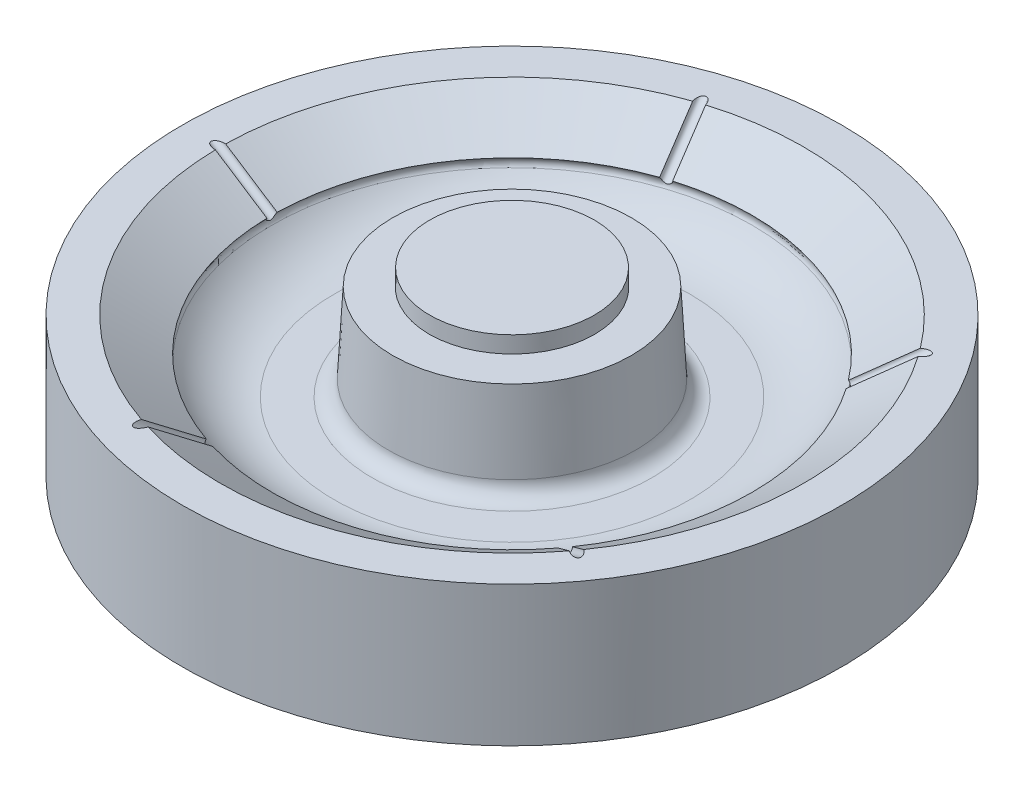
ISO-10303-21;
HEADER;
FILE_DESCRIPTION(('STEP AP214'),'2;1');
FILE_NAME('part.step','',(''),(''),'','','');
FILE_SCHEMA(('AUTOMOTIVE_DESIGN { 1 0 10303 214 1 1 1 1 }'));
ENDSEC;
DATA;
#1=APPLICATION_CONTEXT('core data for automotive mechanical design processes');
#2=APPLICATION_PROTOCOL_DEFINITION('international standard','automotive_design',2000,#1);
#3=PRODUCT_CONTEXT('',#1,'mechanical');
#4=PRODUCT('Part','Part','',(#3));
#5=PRODUCT_RELATED_PRODUCT_CATEGORY('part','',(#4));
#6=PRODUCT_DEFINITION_FORMATION('','',#4);
#7=PRODUCT_DEFINITION_CONTEXT('part definition',#1,'design');
#8=PRODUCT_DEFINITION('design','',#6,#7);
#9=PRODUCT_DEFINITION_SHAPE('','',#8);
#10=(LENGTH_UNIT() NAMED_UNIT(*) SI_UNIT(.MILLI.,.METRE.));
#11=(NAMED_UNIT(*) PLANE_ANGLE_UNIT() SI_UNIT($,.RADIAN.));
#12=(NAMED_UNIT(*) SI_UNIT($,.STERADIAN.) SOLID_ANGLE_UNIT());
#13=UNCERTAINTY_MEASURE_WITH_UNIT(LENGTH_MEASURE(1.E-05),#10,'distance_accuracy_value','');
#14=(GEOMETRIC_REPRESENTATION_CONTEXT(3) GLOBAL_UNCERTAINTY_ASSIGNED_CONTEXT((#13)) GLOBAL_UNIT_ASSIGNED_CONTEXT((#10,
#11,#12)) REPRESENTATION_CONTEXT('',''));
#15=CARTESIAN_POINT('',(0.,0.,0.));
#16=DIRECTION('',(0.,0.,1.));
#17=DIRECTION('',(1.,0.,0.));
#18=AXIS2_PLACEMENT_3D('',#15,#16,#17);
#19=CARTESIAN_POINT('',(0.,-20.32,0.));
#20=DIRECTION('',(0.,-1.,0.));
#21=DIRECTION('',(0.,0.,-1.));
#22=AXIS2_PLACEMENT_3D('',#19,#20,#21);
#23=PLANE('',#22);
#24=CARTESIAN_POINT('',(9.74236522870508,-20.32,10.5762607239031));
#25=CARTESIAN_POINT('',(9.59338969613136,-20.32,10.572368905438));
#26=CARTESIAN_POINT('',(9.30082634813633,-20.32,10.5647260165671));
#27=CARTESIAN_POINT('',(8.87128132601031,-20.32,10.5112626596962));
#28=CARTESIAN_POINT('',(8.461511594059,-20.32,10.4190288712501));
#29=CARTESIAN_POINT('',(8.07048637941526,-20.32,10.292881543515));
#30=CARTESIAN_POINT('',(7.69754406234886,-20.32,10.1325428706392));
#31=CARTESIAN_POINT('',(7.34449833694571,-20.32,9.93283494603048));
#32=CARTESIAN_POINT('',(7.01214175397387,-20.32,9.69452764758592));
#33=CARTESIAN_POINT('',(6.69984953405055,-20.32,9.4243411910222));
#34=CARTESIAN_POINT('',(6.41211844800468,-20.32,9.1235275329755));
#35=CARTESIAN_POINT('',(6.15931473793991,-20.32,8.78819330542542));
#36=CARTESIAN_POINT('',(5.93842174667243,-20.32,8.42446123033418));
#37=CARTESIAN_POINT('',(5.74569434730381,-20.32,8.03331274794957));
#38=CARTESIAN_POINT('',(5.58918123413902,-20.32,7.61119860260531));
#39=CARTESIAN_POINT('',(5.46958451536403,-20.32,7.15961723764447));
#40=CARTESIAN_POINT('',(5.37495039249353,-20.32,6.68052943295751));
#41=CARTESIAN_POINT('',(5.34333544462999,-20.32,6.34968489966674));
#42=CARTESIAN_POINT('',(5.32713085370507,-20.32,6.18010687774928));
#43=B_SPLINE_CURVE_WITH_KNOTS('',3,(#24,#25,#26,#27,#28,#29,#30,#31,#32,#33,#34,#35,#36,#37,#38,
#39,#40,#41,#42),.UNSPECIFIED.,.F.,.F.,(4,1,1,1,1,1,1,1,1,1,1,1,1,1,1,1,4),(0.,
0.0644386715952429,0.126546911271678,0.186887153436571,0.245877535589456,0.304040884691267,
0.36219121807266,0.420975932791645,0.480660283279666,0.540600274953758,0.600689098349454,
0.661935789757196,0.724442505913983,0.789038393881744,0.856313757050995,0.926352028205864,1.),.UNSPECIFIED.);
#44=CARTESIAN_POINT('',(9.74236522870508,-20.32,10.5762607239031));
#45=VERTEX_POINT('',#44);
#46=CARTESIAN_POINT('',(5.32713085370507,-20.32,6.18010687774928));
#47=VERTEX_POINT('',#46);
#48=EDGE_CURVE('E723',#45,#47,#43,.T.);
#49=ORIENTED_EDGE('',*,*,#48,.T.);
#50=DIRECTION('',(-1.,0.,0.));
#51=VECTOR('',#50,1.);
#52=CARTESIAN_POINT('',(5.32713085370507,-20.32,6.18010687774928));
#53=LINE('',#52,#51);
#54=CARTESIAN_POINT('',(3.61751546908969,-20.32,6.18010687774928));
#55=VERTEX_POINT('',#54);
#56=EDGE_CURVE('E282',#47,#55,#53,.T.);
#57=ORIENTED_EDGE('',*,*,#56,.T.);
#58=CARTESIAN_POINT('',(3.61751546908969,-20.32,6.18010687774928));
#59=CARTESIAN_POINT('',(3.62865783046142,-20.32,6.40691556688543));
#60=CARTESIAN_POINT('',(3.65054113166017,-20.32,6.85236179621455));
#61=CARTESIAN_POINT('',(3.75302082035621,-20.32,7.50182477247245));
#62=CARTESIAN_POINT('',(3.89965616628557,-20.32,8.12260874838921));
#63=CARTESIAN_POINT('',(4.10698250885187,-20.32,8.70972928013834));
#64=CARTESIAN_POINT('',(4.36446382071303,-20.32,9.26837764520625));
#65=CARTESIAN_POINT('',(4.67323725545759,-20.32,9.7963348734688));
#66=CARTESIAN_POINT('',(5.03896378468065,-20.32,10.2915869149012));
#67=CARTESIAN_POINT('',(5.45374615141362,-20.32,10.7495426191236));
#68=CARTESIAN_POINT('',(5.90424402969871,-20.32,11.1696635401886));
#69=CARTESIAN_POINT('',(6.39032350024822,-20.32,11.532458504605));
#70=CARTESIAN_POINT('',(6.90110857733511,-20.32,11.8389875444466));
#71=CARTESIAN_POINT('',(7.4350495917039,-20.32,12.0952440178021));
#72=CARTESIAN_POINT('',(7.9981706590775,-20.32,12.287593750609));
#73=CARTESIAN_POINT('',(8.58536164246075,-20.32,12.4303143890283));
#74=CARTESIAN_POINT('',(9.19920237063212,-20.32,12.5161827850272));
#75=CARTESIAN_POINT('',(9.61743163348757,-20.32,12.5254127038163));
#76=CARTESIAN_POINT('',(9.83013566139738,-20.32,12.5301068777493));
#77=B_SPLINE_CURVE_WITH_KNOTS('',3,(#58,#59,#60,#61,#62,#63,#64,#65,#66,#67,#68,#69,#70,#71,#72,
#73,#74,#75,#76),.UNSPECIFIED.,.F.,.F.,(4,1,1,1,1,1,1,1,1,1,1,1,1,1,1,1,4),(0.,
0.0687907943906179,0.135103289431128,0.198978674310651,0.261904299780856,0.323494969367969,
0.385195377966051,0.446969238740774,0.509764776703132,0.572250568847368,0.633405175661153,
0.693251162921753,0.75258316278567,0.812579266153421,0.873275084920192,0.935549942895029,1.),.UNSPECIFIED.);
#78=CARTESIAN_POINT('',(9.83013566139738,-20.32,12.5301068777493));
#79=VERTEX_POINT('',#78);
#80=EDGE_CURVE('E821',#55,#79,#77,.T.);
#81=ORIENTED_EDGE('',*,*,#80,.T.);
#82=CARTESIAN_POINT('',(9.83013566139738,-20.32,12.5301068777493));
#83=CARTESIAN_POINT('',(10.0390220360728,-20.32,12.5252167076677));
#84=CARTESIAN_POINT('',(10.4494763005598,-20.32,12.5156076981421));
#85=CARTESIAN_POINT('',(11.0485281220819,-20.32,12.4330883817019));
#86=CARTESIAN_POINT('',(11.6188159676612,-20.32,12.3038445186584));
#87=CARTESIAN_POINT('',(12.1592250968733,-20.32,12.1225134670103));
#88=CARTESIAN_POINT('',(12.6654438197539,-20.32,11.8787582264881));
#89=CARTESIAN_POINT('',(13.1412749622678,-20.32,11.5859459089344));
#90=CARTESIAN_POINT('',(13.5923833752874,-20.32,11.2472922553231));
#91=CARTESIAN_POINT('',(13.9984574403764,-20.32,10.848582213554));
#92=CARTESIAN_POINT('',(14.3713371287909,-20.32,10.422937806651));
#93=CARTESIAN_POINT('',(14.6930222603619,-20.32,9.96852507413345));
#94=CARTESIAN_POINT('',(14.9685024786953,-20.32,9.499191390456));
#95=CARTESIAN_POINT('',(15.1981239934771,-20.32,9.01135789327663));
#96=CARTESIAN_POINT('',(15.3671581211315,-20.32,8.50043129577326));
#97=CARTESIAN_POINT('',(15.4954909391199,-20.32,7.9738500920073));
#98=CARTESIAN_POINT('',(15.568030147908,-20.32,7.42616362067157));
#99=CARTESIAN_POINT('',(15.5791630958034,-20.32,7.05546936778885));
#100=CARTESIAN_POINT('',(15.5848231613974,-20.32,6.86700591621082));
#101=B_SPLINE_CURVE_WITH_KNOTS('',3,(#82,#83,#84,#85,#86,#87,#88,#89,#90,#91,#92,#93,#94,#95,
#96,#97,#98,#99,#100),.UNSPECIFIED.,.F.,.F.,(4,1,1,1,1,1,1,1,1,1,1,1,1,1,1,1,4),(0.,
0.0694754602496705,0.136516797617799,0.200788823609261,0.263829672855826,0.32573502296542,
0.387290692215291,0.449509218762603,0.512967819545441,0.576275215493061,0.637580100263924,
0.697902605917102,0.757172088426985,0.816598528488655,0.876653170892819,0.93728964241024,1.),.UNSPECIFIED.);
#102=CARTESIAN_POINT('',(15.5848231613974,-20.32,6.86700591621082));
#103=VERTEX_POINT('',#102);
#104=EDGE_CURVE('E814',#79,#103,#101,.T.);
#105=ORIENTED_EDGE('',*,*,#104,.T.);
#106=CARTESIAN_POINT('',(15.5848231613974,-20.32,6.86700591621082));
#107=CARTESIAN_POINT('',(15.5756069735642,-20.32,6.60167841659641));
#108=CARTESIAN_POINT('',(15.5573363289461,-20.32,6.07567953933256));
#109=CARTESIAN_POINT('',(15.4010480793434,-20.32,5.30271292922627));
#110=CARTESIAN_POINT('',(15.1569549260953,-20.32,4.55381160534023));
#111=CARTESIAN_POINT('',(14.8630550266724,-20.32,3.95108428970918));
#112=CARTESIAN_POINT('',(14.5665692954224,-20.32,3.46539913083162));
#113=CARTESIAN_POINT('',(14.2993930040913,-20.32,3.06551946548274));
#114=CARTESIAN_POINT('',(13.9866202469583,-20.32,2.63495970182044));
#115=CARTESIAN_POINT('',(13.6236987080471,-20.32,2.17516162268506));
#116=CARTESIAN_POINT('',(13.2181357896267,-20.32,1.68252369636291));
#117=CARTESIAN_POINT('',(12.7662580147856,-20.32,1.15734352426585));
#118=CARTESIAN_POINT('',(12.2648430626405,-20.32,0.605047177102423));
#119=CARTESIAN_POINT('',(11.9129160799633,-20.32,0.227826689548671));
#120=CARTESIAN_POINT('',(11.7305563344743,-20.32,0.0323604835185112));
#121=B_SPLINE_CURVE_WITH_KNOTS('',3,(#106,#107,#108,#109,#110,#111,#112,#113,#114,#115,#116,
#117,#118,#119,#120),.UNSPECIFIED.,.F.,.F.,(4,1,1,1,1,1,1,1,1,1,1,1,4),(0.,0.0987021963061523,
0.195672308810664,0.292422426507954,0.391342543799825,0.444462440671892,0.504228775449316,
0.570352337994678,0.642545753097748,0.722287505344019,0.807921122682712,0.900469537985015,1.),.UNSPECIFIED.);
#122=CARTESIAN_POINT('',(11.7305563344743,-20.32,0.0323604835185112));
#123=VERTEX_POINT('',#122);
#124=EDGE_CURVE('E810',#103,#123,#121,.T.);
#125=ORIENTED_EDGE('',*,*,#124,.T.);
#126=DIRECTION('',(-0.683740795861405,0.,-0.729724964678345));
#127=VECTOR('',#126,1.);
#128=CARTESIAN_POINT('',(11.7305563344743,-20.32,0.0323604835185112));
#129=LINE('',#128,#127);
#130=CARTESIAN_POINT('',(6.96424022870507,-20.32,-5.0545085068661));
#131=VERTEX_POINT('',#130);
#132=EDGE_CURVE('E808',#123,#131,#129,.T.);
#133=ORIENTED_EDGE('',*,*,#132,.T.);
#134=DIRECTION('',(1.,0.,0.));
#135=VECTOR('',#134,1.);
#136=CARTESIAN_POINT('',(6.96424022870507,-20.32,-5.0545085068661));
#137=LINE('',#136,#135);
#138=CARTESIAN_POINT('',(15.8290539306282,-20.32,-5.0545085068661));
#139=VERTEX_POINT('',#138);
#140=EDGE_CURVE('E806',#131,#139,#137,.T.);
#141=ORIENTED_EDGE('',*,*,#140,.T.);
#142=DIRECTION('',(0.,0.,-1.));
#143=VECTOR('',#142,1.);
#144=CARTESIAN_POINT('',(15.8290539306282,-20.32,-5.0545085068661));
#145=LINE('',#144,#143);
#146=CARTESIAN_POINT('',(15.8290539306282,-20.32,-7.00835466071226));
#147=VERTEX_POINT('',#146);
#148=EDGE_CURVE('E804',#139,#147,#145,.T.);
#149=ORIENTED_EDGE('',*,*,#148,.T.);
#150=DIRECTION('',(-1.,0.,0.));
#151=VECTOR('',#150,1.);
#152=CARTESIAN_POINT('',(15.8290539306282,-20.32,-7.00835466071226));
#153=LINE('',#152,#151);
#154=CARTESIAN_POINT('',(2.88482316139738,-20.32,-7.00835466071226));
#155=VERTEX_POINT('',#154);
#156=EDGE_CURVE('E802',#147,#155,#153,.T.);
#157=ORIENTED_EDGE('',*,*,#156,.T.);
#158=DIRECTION('',(0.683776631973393,0.,0.729691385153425));
#159=VECTOR('',#158,1.);
#160=CARTESIAN_POINT('',(2.88482316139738,-20.32,-7.00835466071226));
#161=LINE('',#160,#159);
#162=CARTESIAN_POINT('',(10.2728039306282,-20.32,0.875719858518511));
#163=VERTEX_POINT('',#162);
#164=EDGE_CURVE('E797',#155,#163,#161,.T.);
#165=ORIENTED_EDGE('',*,*,#164,.T.);
#166=CARTESIAN_POINT('',(10.2728039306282,-20.32,0.875719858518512));
#167=CARTESIAN_POINT('',(10.4526788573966,-20.32,1.06348921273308));
#168=CARTESIAN_POINT('',(10.7981817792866,-20.32,1.42415571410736));
#169=CARTESIAN_POINT('',(11.2868555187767,-20.32,1.95071382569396));
#170=CARTESIAN_POINT('',(11.7257620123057,-20.32,2.43920775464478));
#171=CARTESIAN_POINT('',(12.1177423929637,-20.32,2.88871453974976));
#172=CARTESIAN_POINT('',(12.454293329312,-20.32,3.30580921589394));
#173=CARTESIAN_POINT('',(12.7529550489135,-20.32,3.67698324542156));
#174=CARTESIAN_POINT('',(12.9922534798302,-20.32,4.01854675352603));
#175=CARTESIAN_POINT('',(13.2519615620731,-20.32,4.41446352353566));
#176=CARTESIAN_POINT('',(13.5034976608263,-20.32,4.89785627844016));
#177=CARTESIAN_POINT('',(13.7196463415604,-20.32,5.48858964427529));
#178=CARTESIAN_POINT('',(13.8514443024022,-20.32,6.09670511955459));
#179=CARTESIAN_POINT('',(13.8672549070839,-20.32,6.50765192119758));
#180=CARTESIAN_POINT('',(13.875207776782,-20.32,6.71436168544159));
#181=B_SPLINE_CURVE_WITH_KNOTS('',3,(#166,#167,#168,#169,#170,#171,#172,#173,#174,#175,#176,
#177,#178,#179,#180),.UNSPECIFIED.,.F.,.F.,(4,1,1,1,1,1,1,1,1,1,1,1,4),(0.,0.110802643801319,
0.21282920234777,0.306101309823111,0.39064732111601,0.466924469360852,0.534481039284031,
0.593586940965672,0.644557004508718,0.736200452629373,0.825024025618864,0.911985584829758,1.),.UNSPECIFIED.);
#182=CARTESIAN_POINT('',(13.875207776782,-20.32,6.71436168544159));
#183=VERTEX_POINT('',#182);
#184=EDGE_CURVE('E53',#163,#183,#181,.T.);
#185=ORIENTED_EDGE('',*,*,#184,.T.);
#186=CARTESIAN_POINT('',(13.875207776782,-20.32,6.71436168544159));
#187=CARTESIAN_POINT('',(13.8717475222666,-20.32,6.84434472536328));
#188=CARTESIAN_POINT('',(13.8649280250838,-20.32,7.10051633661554));
#189=CARTESIAN_POINT('',(13.8047425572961,-20.32,7.4761048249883));
#190=CARTESIAN_POINT('',(13.7137896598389,-20.32,7.83840759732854));
#191=CARTESIAN_POINT('',(13.5834590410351,-20.32,8.18853908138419));
#192=CARTESIAN_POINT('',(13.4114280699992,-20.32,8.5229789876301));
#193=CARTESIAN_POINT('',(13.2020229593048,-20.32,8.84213441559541));
#194=CARTESIAN_POINT('',(12.960414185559,-20.32,9.15068435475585));
#195=CARTESIAN_POINT('',(12.6809165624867,-20.32,9.43999016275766));
#196=CARTESIAN_POINT('',(12.373876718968,-20.32,9.70495500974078));
#197=CARTESIAN_POINT('',(12.0495137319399,-20.32,9.93967324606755));
#198=CARTESIAN_POINT('',(11.7063410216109,-20.32,10.1358289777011));
#199=CARTESIAN_POINT('',(11.3458054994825,-20.32,10.2966300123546));
#200=CARTESIAN_POINT('',(10.9689123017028,-20.32,10.4227703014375));
#201=CARTESIAN_POINT('',(10.5749324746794,-20.32,10.5101748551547));
#202=CARTESIAN_POINT('',(10.1649546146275,-20.32,10.5650523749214));
#203=CARTESIAN_POINT('',(9.88500944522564,-20.32,10.572477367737));
#204=CARTESIAN_POINT('',(9.74236522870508,-20.32,10.5762607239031));
#205=B_SPLINE_CURVE_WITH_KNOTS('',3,(#186,#187,#188,#189,#190,#191,#192,#193,#194,#195,#196,
#197,#198,#199,#200,#201,#202,#203,#204),.UNSPECIFIED.,.F.,.F.,(4,1,1,1,1,1,1,1,1,1,1,1,1,1,1,1,
4),(0.,0.0619654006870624,0.122121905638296,0.180988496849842,0.239933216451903,
0.299905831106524,0.359988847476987,0.421775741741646,0.486575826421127,0.551534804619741,
0.61501754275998,0.677258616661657,0.739729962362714,0.803050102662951,0.866495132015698,
0.931973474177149,1.),.UNSPECIFIED.);
#206=EDGE_CURVE('E48',#183,#45,#205,.T.);
#207=ORIENTED_EDGE('',*,*,#206,.T.);
#208=EDGE_LOOP('',(#49,#57,#81,#105,#125,#133,#141,#149,#157,#165,#185,#207));
#209=FACE_BOUND('',#208,.T.);
#210=DIRECTION('',(0.,0.,1.));
#211=VECTOR('',#210,1.);
#212=CARTESIAN_POINT('',(-11.524792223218,-20.32,-7.00835466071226));
#213=LINE('',#212,#211);
#214=CARTESIAN_POINT('',(-11.524792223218,-20.32,-7.00835466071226));
#215=VERTEX_POINT('',#214);
#216=CARTESIAN_POINT('',(-11.524792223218,-20.32,12.0416453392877));
#217=VERTEX_POINT('',#216);
#218=EDGE_CURVE('E375',#215,#217,#213,.T.);
#219=ORIENTED_EDGE('',*,*,#218,.T.);
#220=DIRECTION('',(1.,0.,0.));
#221=VECTOR('',#220,1.);
#222=CARTESIAN_POINT('',(-11.524792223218,-20.32,12.0416453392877));
#223=LINE('',#222,#221);
#224=CARTESIAN_POINT('',(-7.71250255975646,-20.32,12.0416453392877));
#225=VERTEX_POINT('',#224);
#226=EDGE_CURVE('E645',#217,#225,#223,.T.);
#227=ORIENTED_EDGE('',*,*,#226,.T.);
#228=CARTESIAN_POINT('',(-7.71250255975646,-20.32,12.0416453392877));
#229=CARTESIAN_POINT('',(-7.45809727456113,-20.32,12.0407985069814));
#230=CARTESIAN_POINT('',(-6.96961094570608,-20.32,12.039172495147));
#231=CARTESIAN_POINT('',(-6.26980500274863,-20.32,12.0301059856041));
#232=CARTESIAN_POINT('',(-5.63393180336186,-20.32,12.004119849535));
#233=CARTESIAN_POINT('',(-5.06232382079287,-20.32,11.9817574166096));
#234=CARTESIAN_POINT('',(-4.5549915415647,-20.32,11.940979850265));
#235=CARTESIAN_POINT('',(-4.11037928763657,-20.32,11.9020054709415));
#236=CARTESIAN_POINT('',(-3.73053481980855,-20.32,11.8509859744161));
#237=CARTESIAN_POINT('',(-3.50059668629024,-20.32,11.803603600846));
#238=CARTESIAN_POINT('',(-3.39648693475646,-20.32,11.78215014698));
#239=B_SPLINE_CURVE_WITH_KNOTS('',3,(#228,#229,#230,#231,#232,#233,#234,#235,#236,#237,#238),
.UNSPECIFIED.,.F.,.F.,(4,1,1,1,1,1,1,1,4),(0.,0.1762577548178,0.338434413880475,
0.484822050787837,0.617157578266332,0.734698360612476,0.83738518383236,0.926372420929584,1.),.UNSPECIFIED.);
#240=CARTESIAN_POINT('',(-3.39648693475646,-20.32,11.78215014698));
#241=VERTEX_POINT('',#240);
#242=EDGE_CURVE('E638',#225,#241,#239,.T.);
#243=ORIENTED_EDGE('',*,*,#242,.T.);
#244=CARTESIAN_POINT('',(-3.39648693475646,-20.32,11.78215014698));
#245=CARTESIAN_POINT('',(-3.25711373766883,-20.32,11.7477144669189));
#246=CARTESIAN_POINT('',(-2.9813405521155,-20.32,11.6795777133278));
#247=CARTESIAN_POINT('',(-2.58428376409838,-20.32,11.5355618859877));
#248=CARTESIAN_POINT('',(-2.20592722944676,-20.32,11.3689036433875));
#249=CARTESIAN_POINT('',(-1.84784261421,-20.32,11.1731582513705));
#250=CARTESIAN_POINT('',(-1.51182352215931,-20.32,10.9468726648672));
#251=CARTESIAN_POINT('',(-1.19440528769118,-20.32,10.6939533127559));
#252=CARTESIAN_POINT('',(-0.894147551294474,-20.32,10.4157840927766));
#253=CARTESIAN_POINT('',(-0.623193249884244,-20.32,10.1053515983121));
#254=CARTESIAN_POINT('',(-0.367710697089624,-20.32,9.77967002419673));
#255=CARTESIAN_POINT('',(-0.152235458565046,-20.32,9.42749671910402));
#256=CARTESIAN_POINT('',(0.0335100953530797,-20.32,9.05922469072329));
#257=CARTESIAN_POINT('',(0.181395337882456,-20.32,8.67110860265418));
#258=CARTESIAN_POINT('',(0.300474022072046,-20.32,8.2669123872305));
#259=CARTESIAN_POINT('',(0.384436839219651,-20.32,7.84297479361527));
#260=CARTESIAN_POINT('',(0.434789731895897,-20.32,7.40122720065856));
#261=CARTESIAN_POINT('',(0.439916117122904,-20.32,7.09992201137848));
#262=CARTESIAN_POINT('',(0.44251546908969,-20.32,6.94714413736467));
#263=B_SPLINE_CURVE_WITH_KNOTS('',3,(#244,#245,#246,#247,#248,#249,#250,#251,#252,#253,#254,
#255,#256,#257,#258,#259,#260,#261,#262),.UNSPECIFIED.,.F.,.F.,(4,1,1,1,1,1,1,1,1,1,1,1,1,1,1,1,
4),(0.,0.0642168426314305,0.127063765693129,0.18874453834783,0.249132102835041,
0.309452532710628,0.369826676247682,0.430650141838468,0.492351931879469,0.554072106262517,
0.615689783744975,0.676797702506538,0.738439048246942,0.801316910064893,0.865184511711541,
0.931641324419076,1.),.UNSPECIFIED.);
#264=CARTESIAN_POINT('',(0.44251546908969,-20.32,6.94714413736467));
#265=VERTEX_POINT('',#264);
#266=EDGE_CURVE('E631',#241,#265,#263,.T.);
#267=ORIENTED_EDGE('',*,*,#266,.T.);
#268=CARTESIAN_POINT('',(0.44251546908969,-20.32,6.94714413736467));
#269=CARTESIAN_POINT('',(0.434519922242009,-20.32,6.6933159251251));
#270=CARTESIAN_POINT('',(0.418918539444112,-20.32,6.1980313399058));
#271=CARTESIAN_POINT('',(0.273457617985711,-20.32,5.47924282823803));
#272=CARTESIAN_POINT('',(0.0351882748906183,-20.32,4.80874098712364));
#273=CARTESIAN_POINT('',(-0.293142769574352,-20.32,4.18737005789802));
#274=CARTESIAN_POINT('',(-0.711260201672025,-20.32,3.6272421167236));
#275=CARTESIAN_POINT('',(-1.21377085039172,-20.32,3.13525978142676));
#276=CARTESIAN_POINT('',(-1.80095505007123,-20.32,2.72356254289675));
#277=CARTESIAN_POINT('',(-2.34757746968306,-20.32,2.43806942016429));
#278=CARTESIAN_POINT('',(-2.83043618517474,-20.32,2.25522801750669));
#279=CARTESIAN_POINT('',(-3.22794607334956,-20.32,2.12657869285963));
#280=CARTESIAN_POINT('',(-3.66156205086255,-20.32,2.02718142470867));
#281=CARTESIAN_POINT('',(-4.12712954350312,-20.32,1.93813556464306));
#282=CARTESIAN_POINT('',(-4.62658601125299,-20.32,1.87090705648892));
#283=CARTESIAN_POINT('',(-5.15873436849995,-20.32,1.82166773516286));
#284=CARTESIAN_POINT('',(-5.723954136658,-20.32,1.79089355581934));
#285=CARTESIAN_POINT('',(-6.11224249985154,-20.32,1.78631064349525));
#286=CARTESIAN_POINT('',(-6.31199174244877,-20.32,1.78395303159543));
#287=B_SPLINE_CURVE_WITH_KNOTS('',3,(#268,#269,#270,#271,#272,#273,#274,#275,#276,#277,#278,
#279,#280,#281,#282,#283,#284,#285,#286),.UNSPECIFIED.,.F.,.F.,(4,1,1,1,1,1,1,1,1,1,1,1,1,1,1,1,
4),(0.,0.0787802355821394,0.153720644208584,0.226713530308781,0.299191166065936,
0.371189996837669,0.44300641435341,0.516689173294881,0.593217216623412,0.633872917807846,
0.676989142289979,0.722899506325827,0.771958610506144,0.824211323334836,0.879378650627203,
0.937948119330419,1.),.UNSPECIFIED.);
#288=CARTESIAN_POINT('',(-6.31199174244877,-20.32,1.78395303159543));
#289=VERTEX_POINT('',#288);
#290=EDGE_CURVE('E627',#265,#289,#287,.T.);
#291=ORIENTED_EDGE('',*,*,#290,.T.);
#292=DIRECTION('',(0.622788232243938,0.,-0.782390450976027));
#293=VECTOR('',#292,1.);
#294=CARTESIAN_POINT('',(-6.31199174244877,-20.32,1.78395303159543));
#295=LINE('',#294,#293);
#296=CARTESIAN_POINT('',(0.68674623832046,-20.32,-7.00835466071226));
#297=VERTEX_POINT('',#296);
#298=EDGE_CURVE('E625',#289,#297,#295,.T.);
#299=ORIENTED_EDGE('',*,*,#298,.T.);
#300=DIRECTION('',(-1.,0.,0.));
#301=VECTOR('',#300,1.);
#302=CARTESIAN_POINT('',(0.686746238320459,-20.32,-7.00835466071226));
#303=LINE('',#302,#301);
#304=CARTESIAN_POINT('',(-1.42737635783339,-20.32,-7.00835466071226));
#305=VERTEX_POINT('',#304);
#306=EDGE_CURVE('E623',#297,#305,#303,.T.);
#307=ORIENTED_EDGE('',*,*,#306,.T.);
#308=DIRECTION('',(-0.622788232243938,0.,0.782390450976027));
#309=VECTOR('',#308,1.);
#310=CARTESIAN_POINT('',(-1.42737635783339,-20.32,-7.00835466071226));
#311=LINE('',#310,#309);
#312=CARTESIAN_POINT('',(-8.42611433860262,-20.32,1.78395303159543));
#313=VERTEX_POINT('',#312);
#314=EDGE_CURVE('E621',#305,#313,#311,.T.);
#315=ORIENTED_EDGE('',*,*,#314,.T.);
#316=DIRECTION('',(-1.,0.,0.));
#317=VECTOR('',#316,1.);
#318=CARTESIAN_POINT('',(-8.42611433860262,-20.32,1.78395303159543));
#319=LINE('',#318,#317);
#320=CARTESIAN_POINT('',(-9.81517683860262,-20.32,1.78395303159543));
#321=VERTEX_POINT('',#320);
#322=EDGE_CURVE('E619',#313,#321,#319,.T.);
#323=ORIENTED_EDGE('',*,*,#322,.T.);
#324=DIRECTION('',(0.,0.,-1.));
#325=VECTOR('',#324,1.);
#326=CARTESIAN_POINT('',(-9.81517683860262,-20.32,1.78395303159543));
#327=LINE('',#326,#325);
#328=CARTESIAN_POINT('',(-9.81517683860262,-20.32,-7.00835466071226));
#329=VERTEX_POINT('',#328);
#330=EDGE_CURVE('E617',#321,#329,#327,.T.);
#331=ORIENTED_EDGE('',*,*,#330,.T.);
#332=DIRECTION('',(-1.,0.,0.));
#333=VECTOR('',#332,1.);
#334=CARTESIAN_POINT('',(-9.81517683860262,-20.32,-7.00835466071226));
#335=LINE('',#334,#333);
#336=EDGE_CURVE('E380',#329,#215,#335,.T.);
#337=ORIENTED_EDGE('',*,*,#336,.T.);
#338=EDGE_LOOP('',(#219,#227,#243,#267,#291,#299,#307,#315,#323,#331,#337));
#339=FACE_BOUND('',#338,.T.);
#340=CARTESIAN_POINT('',(0.,-20.32,0.));
#341=DIRECTION('',(0.,-1.,0.));
#342=DIRECTION('',(0.,0.,-1.));
#343=AXIS2_PLACEMENT_3D('',#340,#341,#342);
#344=CIRCLE('',#343,38.1);
#345=CARTESIAN_POINT('',(0.,-20.32,-38.1));
#346=VERTEX_POINT('',#345);
#347=EDGE_CURVE('E547',#346,#346,#344,.T.);
#348=ORIENTED_EDGE('',*,*,#347,.T.);
#349=EDGE_LOOP('',(#348));
#350=FACE_BOUND('',#349,.T.);
#351=ADVANCED_FACE('F33',(#209,#339,#350),#23,.T.);
#352=CARTESIAN_POINT('',(0.,0.,0.));
#353=DIRECTION('',(0.,1.,0.));
#354=DIRECTION('',(0.,0.,1.));
#355=AXIS2_PLACEMENT_3D('',#352,#353,#354);
#356=CONICAL_SURFACE('',#355,50.8,0.99410829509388);
#357=CARTESIAN_POINT('',(-19.5436151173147,6.50884246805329,-57.5804498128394));
#358=CARTESIAN_POINT('',(-19.4065359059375,6.22033130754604,-57.1585636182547));
#359=CARTESIAN_POINT('',(-19.2694566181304,5.93182051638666,-56.7366771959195));
#360=CARTESIAN_POINT('',(-18.5840597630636,4.48926856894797,-54.6272438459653));
#361=CARTESIAN_POINT('',(-18.0357409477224,3.3352334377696,-52.9396932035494));
#362=CARTESIAN_POINT('',(-17.1419930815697,1.45420091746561,-50.1890223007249));
#363=CARTESIAN_POINT('',(-16.7965650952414,0.727198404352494,-49.1259051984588));
#364=CARTESIAN_POINT('',(-16.314055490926,-0.288303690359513,-47.640894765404));
#365=CARTESIAN_POINT('',(-16.1769745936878,-0.576806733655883,-47.2190035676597));
#366=CARTESIAN_POINT('',(-15.4915693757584,-2.01931843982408,-45.109545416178));
#367=CARTESIAN_POINT('',(-14.943242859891,-3.17331657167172,-43.4219719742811));
#368=CARTESIAN_POINT('',(-13.6588967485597,-5.87627671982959,-39.4691668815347));
#369=CARTESIAN_POINT('',(-12.9228745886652,-7.4252264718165,-37.2039276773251));
#370=CARTESIAN_POINT('',(-12.0428420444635,-9.27716241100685,-34.495472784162));
#371=CARTESIAN_POINT('',(-11.8988412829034,-9.58019424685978,-34.0522851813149));
#372=CARTESIAN_POINT('',(-11.7548401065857,-9.88322411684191,-33.6090963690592));
#373=B_SPLINE_CURVE_WITH_KNOTS('',3,(#357,#358,#359,#360,#361,#362,#363,#364,#365,#366,#367,
#368,#369,#370,#371,#372),.UNSPECIFIED.,.F.,.F.,(4,2,2,2,2,2,2,4),(0.,1.5875000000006,
7.93750000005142,11.9378299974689,13.5253299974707,19.8753299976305,28.3988588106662,
30.0664372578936),.UNSPECIFIED.);
#374=CARTESIAN_POINT('',(-14.6407139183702,-3.81,-42.4908850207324));
#375=VERTEX_POINT('',#374);
#376=CARTESIAN_POINT('',(-12.1869374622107,-8.97392875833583,-34.9389517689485));
#377=VERTEX_POINT('',#376);
#378=EDGE_CURVE('E456',#375,#377,#373,.T.);
#379=ORIENTED_EDGE('',*,*,#378,.F.);
#380=CARTESIAN_POINT('',(0.,-3.81,0.));
#381=DIRECTION('',(0.,1.,0.));
#382=DIRECTION('',(0.,0.,1.));
#383=AXIS2_PLACEMENT_3D('',#380,#381,#382);
#384=CIRCLE('',#383,44.9424722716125);
#385=CARTESIAN_POINT('',(-44.9354624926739,-3.81,-0.793740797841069));
#386=VERTEX_POINT('',#385);
#387=EDGE_CURVE('E576',#375,#386,#384,.T.);
#388=ORIENTED_EDGE('',*,*,#387,.T.);
#389=CARTESIAN_POINT('',(-36.9945809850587,-8.97412875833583,-0.793736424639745));
#390=CARTESIAN_POINT('',(-37.4381974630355,-8.68564690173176,-0.79373674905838));
#391=CARTESIAN_POINT('',(-37.8818129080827,-8.39716345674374,-0.793737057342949));
#392=CARTESIAN_POINT('',(-40.0998853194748,-6.95473882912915,-0.79373852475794));
#393=CARTESIAN_POINT('',(-41.8743278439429,-5.80077543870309,-0.793739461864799));
#394=CARTESIAN_POINT('',(-46.0305577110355,-3.09782151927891,-0.79374130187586));
#395=CARTESIAN_POINT('',(-48.412336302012,-1.54881753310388,-0.793742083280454));
#396=CARTESIAN_POINT('',(-50.7941060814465,0.000200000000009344,-0.793742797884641));
#397=B_SPLINE_CURVE_WITH_KNOTS('',3,(#389,#390,#391,#392,#393,#394,#395,#396),.UNSPECIFIED.,.F.,
.F.,(4,2,2,4),(0.,1.58750000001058,7.93750000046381,16.4610288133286),.UNSPECIFIED.);
#398=CARTESIAN_POINT('',(-36.9948885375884,-8.97392875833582,-0.793736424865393));
#399=VERTEX_POINT('',#398);
#400=EDGE_CURVE('E489',#399,#386,#397,.T.);
#401=ORIENTED_EDGE('',*,*,#400,.F.);
#402=CARTESIAN_POINT('',(0.,-8.97392875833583,0.));
#403=DIRECTION('',(0.,-1.,0.));
#404=DIRECTION('',(0.,0.,-1.));
#405=AXIS2_PLACEMENT_3D('',#402,#403,#404);
#406=CIRCLE('',#405,37.0034024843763);
#407=EDGE_CURVE('E1319',#377,#399,#406,.F.);
#408=ORIENTED_EDGE('',*,*,#407,.F.);
#409=EDGE_LOOP('',(#379,#388,#401,#408));
#410=FACE_BOUND('',#409,.T.);
#411=ADVANCED_FACE('F468',(#410),#356,.F.);
#412=CARTESIAN_POINT('',(49.9044900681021,6.70856510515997,35.2766115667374));
#413=CARTESIAN_POINT('',(49.5456122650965,6.42005377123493,35.0158716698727));
#414=CARTESIAN_POINT('',(49.1867342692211,6.1315428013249,34.7551316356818));
#415=CARTESIAN_POINT('',(47.3923432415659,4.68898992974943,33.4514307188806));
#416=CARTESIAN_POINT('',(45.9568270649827,3.53495396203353,32.4084675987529));
#417=CARTESIAN_POINT('',(43.5341550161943,1.58734663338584,30.6482941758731));
#418=CARTESIAN_POINT('',(42.5470014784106,0.793770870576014,29.9310855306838));
#419=CARTESIAN_POINT('',(41.2009634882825,-0.288303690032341,28.9531322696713));
#420=CARTESIAN_POINT('',(40.8420812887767,-0.576806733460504,28.6923892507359));
#421=CARTESIAN_POINT('',(39.0476684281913,-2.01931844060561,27.3886728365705));
#422=CARTESIAN_POINT('',(37.6121321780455,-3.1733165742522,26.3456954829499));
#423=CARTESIAN_POINT('',(34.2496738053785,-5.87627671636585,23.9027286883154));
#424=CARTESIAN_POINT('',(32.3227451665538,-7.42522645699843,22.5027346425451));
#425=CARTESIAN_POINT('',(30.0368954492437,-9.26261235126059,20.8419701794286));
#426=CARTESIAN_POINT('',(29.6779987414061,-9.55109429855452,20.5812168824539));
#427=CARTESIAN_POINT('',(29.3191010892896,-9.83957447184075,20.3204629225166));
#428=B_SPLINE_CURVE_WITH_KNOTS('',3,(#412,#413,#414,#415,#416,#417,#418,#419,#420,#421,#422,
#423,#424,#425,#426,#427),.UNSPECIFIED.,.F.,.F.,(4,2,2,2,2,2,2,4),(0.,1.58750000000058,
7.93750000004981,12.3041469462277,13.8916469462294,20.2416469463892,28.7651757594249,
30.3526859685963),.UNSPECIFIED.);
#429=CARTESIAN_POINT('',(36.8201019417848,-3.81,25.7702523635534));
#430=VERTEX_POINT('',#429);
#431=CARTESIAN_POINT('',(30.396040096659,-8.97392875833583,21.1029036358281));
#432=VERTEX_POINT('',#431);
#433=EDGE_CURVE('E513',#430,#432,#428,.T.);
#434=ORIENTED_EDGE('',*,*,#433,.F.);
#435=CARTESIAN_POINT('',(0.,-3.81,0.));
#436=DIRECTION('',(0.,1.,0.));
#437=DIRECTION('',(0.,0.,1.));
#438=AXIS2_PLACEMENT_3D('',#435,#436,#437);
#439=CIRCLE('',#438,44.9424722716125);
#440=CARTESIAN_POINT('',(36.8201019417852,-3.81,-25.7702523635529));
#441=VERTEX_POINT('',#440);
#442=EDGE_CURVE('E566',#430,#441,#439,.T.);
#443=ORIENTED_EDGE('',*,*,#442,.T.);
#444=CARTESIAN_POINT('',(30.3957912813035,-8.97412875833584,-21.1027228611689));
#445=CARTESIAN_POINT('',(30.7546847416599,-8.68564690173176,-21.3634738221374));
#446=CARTESIAN_POINT('',(31.1135773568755,-8.39716345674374,-21.6242241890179));
#447=CARTESIAN_POINT('',(32.9080364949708,-6.95473882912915,-22.9279732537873));
#448=CARTESIAN_POINT('',(34.3435912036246,-5.80077543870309,-23.9709636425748));
#449=CARTESIAN_POINT('',(37.7060528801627,-3.09782151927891,-26.4139327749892));
#450=CARTESIAN_POINT('',(39.6329526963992,-1.54881753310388,-27.8139064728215));
#451=CARTESIAN_POINT('',(41.5598453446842,0.000200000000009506,-29.213875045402));
#452=B_SPLINE_CURVE_WITH_KNOTS('',3,(#444,#445,#446,#447,#448,#449,#450,#451),.UNSPECIFIED.,.F.,
.F.,(4,2,2,4),(0.,1.58750000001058,7.93750000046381,16.4610288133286),.UNSPECIFIED.);
#453=CARTESIAN_POINT('',(30.3960400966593,-8.97392875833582,-21.1029036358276));
#454=VERTEX_POINT('',#453);
#455=EDGE_CURVE('E457',#454,#441,#452,.T.);
#456=ORIENTED_EDGE('',*,*,#455,.F.);
#457=EDGE_CURVE('E1339',#432,#454,#406,.F.);
#458=ORIENTED_EDGE('',*,*,#457,.F.);
#459=EDGE_LOOP('',(#434,#443,#456,#458));
#460=FACE_BOUND('',#459,.T.);
#461=ADVANCED_FACE('F472',(#460),#356,.F.);
#462=CARTESIAN_POINT('',(-18.0338251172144,6.50884806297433,58.0710193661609));
#463=CARTESIAN_POINT('',(-17.8967460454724,6.22033690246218,57.6491331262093));
#464=CARTESIAN_POINT('',(-17.7596669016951,5.93182611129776,57.2272466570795));
#465=CARTESIAN_POINT('',(-17.0742707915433,4.48927416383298,55.1178130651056));
#466=CARTESIAN_POINT('',(-16.5259526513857,3.33523903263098,53.4302622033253));
#467=CARTESIAN_POINT('',(-15.6322051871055,1.45420464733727,50.6795881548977));
#468=CARTESIAN_POINT('',(-15.2867768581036,0.727200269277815,49.6164681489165));
#469=CARTESIAN_POINT('',(-14.8042672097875,-0.288303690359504,48.1314547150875));
#470=CARTESIAN_POINT('',(-14.6671865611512,-0.576806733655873,47.7095634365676));
#471=CARTESIAN_POINT('',(-13.9817826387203,-2.01931843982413,45.6001048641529));
#472=CARTESIAN_POINT('',(-13.4334573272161,-3.17331657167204,43.9125310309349));
#473=CARTESIAN_POINT('',(-12.1491146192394,-5.87627671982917,39.9597248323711));
#474=CARTESIAN_POINT('',(-11.4130948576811,-7.42522647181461,37.6944848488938));
#475=CARTESIAN_POINT('',(-10.5330671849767,-9.2771605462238,34.9860313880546));
#476=CARTESIAN_POINT('',(-10.3890679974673,-9.58019051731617,34.542846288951));
#477=CARTESIAN_POINT('',(-10.2450684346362,-9.88321852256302,34.0996599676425));
#478=B_SPLINE_CURVE_WITH_KNOTS('',3,(#462,#463,#464,#465,#466,#467,#468,#469,#470,#471,#472,
#473,#474,#475,#476,#477),.UNSPECIFIED.,.F.,.F.,(4,2,2,2,2,2,2,4),(0.,1.5875000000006,
7.93750000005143,11.9378402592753,13.5253402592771,19.8753402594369,28.3988690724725,
30.0664372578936),.UNSPECIFIED.);
#479=CARTESIAN_POINT('',(-13.1309292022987,-3.81,42.9814438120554));
#480=VERTEX_POINT('',#479);
#481=CARTESIAN_POINT('',(-10.6771610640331,-8.97392875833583,35.429507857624));
#482=VERTEX_POINT('',#481);
#483=EDGE_CURVE('E506',#480,#482,#478,.T.);
#484=ORIENTED_EDGE('',*,*,#483,.F.);
#485=CARTESIAN_POINT('',(0.,-3.81,0.));
#486=DIRECTION('',(0.,1.,0.));
#487=DIRECTION('',(0.,0.,1.));
#488=AXIS2_PLACEMENT_3D('',#485,#486,#487);
#489=CIRCLE('',#488,44.9424722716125);
#490=CARTESIAN_POINT('',(35.8870036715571,-3.81,27.0545519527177));
#491=VERTEX_POINT('',#490);
#492=EDGE_CURVE('E559',#480,#491,#489,.T.);
#493=ORIENTED_EDGE('',*,*,#492,.T.);
#494=CARTESIAN_POINT('',(29.462698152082,-8.97412875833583,22.3870153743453));
#495=CARTESIAN_POINT('',(29.8215912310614,-8.68564690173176,22.6477668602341));
#496=CARTESIAN_POINT('',(30.1804834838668,-8.39716345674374,22.9085177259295));
#497=CARTESIAN_POINT('',(31.9749408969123,-6.95473882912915,24.2122691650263));
#498=CARTESIAN_POINT('',(33.4104945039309,-5.80077543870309,25.2552610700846));
#499=CARTESIAN_POINT('',(36.7729540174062,-3.09782151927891,27.6982331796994));
#500=CARTESIAN_POINT('',(38.6998529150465,-1.54881753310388,29.098208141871));
#501=CARTESIAN_POINT('',(40.6267447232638,0.000200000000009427,30.4981778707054));
#502=B_SPLINE_CURVE_WITH_KNOTS('',3,(#494,#495,#496,#497,#498,#499,#500,#501),.UNSPECIFIED.,.F.,
.F.,(4,2,2,4),(0.,1.58750000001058,7.93750000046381,16.4610288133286),.UNSPECIFIED.);
#503=CARTESIAN_POINT('',(29.4629469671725,-8.97392875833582,22.3871961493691));
#504=VERTEX_POINT('',#503);
#505=EDGE_CURVE('E520',#504,#491,#502,.T.);
#506=ORIENTED_EDGE('',*,*,#505,.F.);
#507=EDGE_CURVE('E1317',#482,#504,#406,.F.);
#508=ORIENTED_EDGE('',*,*,#507,.F.);
#509=EDGE_LOOP('',(#484,#493,#506,#508));
#510=FACE_BOUND('',#509,.T.);
#511=ADVANCED_FACE('F1160',(#510),#356,.F.);
#512=CARTESIAN_POINT('',(48.9713868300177,6.70856510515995,-36.5609179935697));
#513=CARTESIAN_POINT('',(48.6125091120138,6.42005377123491,-36.3001779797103));
#514=CARTESIAN_POINT('',(48.2536312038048,6.13154280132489,-36.039437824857));
#515=CARTESIAN_POINT('',(46.4592406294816,4.68898992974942,-34.7357362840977));
#516=CARTESIAN_POINT('',(45.0237248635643,3.53495396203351,-33.6927725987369));
#517=CARTESIAN_POINT('',(42.6010536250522,1.58734663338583,-31.9325980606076));
#518=CARTESIAN_POINT('',(41.6139004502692,0.793770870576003,-31.2153889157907));
#519=CARTESIAN_POINT('',(40.2678630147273,-0.288303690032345,-30.2374348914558));
#520=CARTESIAN_POINT('',(39.9089809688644,-0.576806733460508,-29.9766916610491));
#521=CARTESIAN_POINT('',(38.1145689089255,-2.01931844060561,-28.6729741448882));
#522=CARTESIAN_POINT('',(36.6790334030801,-3.17331657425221,-27.6299957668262));
#523=CARTESIAN_POINT('',(33.3165771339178,-5.87627671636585,-25.1870260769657));
#524=CARTESIAN_POINT('',(31.3896499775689,-7.42522645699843,-23.7870299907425));
#525=CARTESIAN_POINT('',(29.1038027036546,-9.26261235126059,-22.1262621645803));
#526=CARTESIAN_POINT('',(28.7449063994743,-9.55109429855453,-21.8655083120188));
#527=CARTESIAN_POINT('',(28.3860091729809,-9.83957447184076,-21.6047537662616));
#528=B_SPLINE_CURVE_WITH_KNOTS('',3,(#512,#513,#514,#515,#516,#517,#518,#519,#520,#521,#522,
#523,#524,#525,#526,#527),.UNSPECIFIED.,.F.,.F.,(4,2,2,2,2,2,2,4),(0.,1.58750000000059,
7.93750000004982,12.3041469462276,13.8916469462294,20.2416469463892,28.7651757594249,
30.3526859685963),.UNSPECIFIED.);
#529=CARTESIAN_POINT('',(35.8870036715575,-3.81,-27.0545519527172));
#530=VERTEX_POINT('',#529);
#531=CARTESIAN_POINT('',(29.4629469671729,-8.97392875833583,-22.3871961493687));
#532=VERTEX_POINT('',#531);
#533=EDGE_CURVE('E526',#530,#532,#528,.T.);
#534=ORIENTED_EDGE('',*,*,#533,.F.);
#535=CARTESIAN_POINT('',(0.,-3.81,0.));
#536=DIRECTION('',(0.,1.,0.));
#537=DIRECTION('',(0.,0.,1.));
#538=AXIS2_PLACEMENT_3D('',#535,#536,#537);
#539=CIRCLE('',#538,44.9424722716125);
#540=CARTESIAN_POINT('',(-13.1309292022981,-3.81,-42.9814438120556));
#541=VERTEX_POINT('',#540);
#542=EDGE_CURVE('E579',#530,#541,#539,.T.);
#543=ORIENTED_EDGE('',*,*,#542,.T.);
#544=CARTESIAN_POINT('',(-10.2450684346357,-9.88321852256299,-34.0996599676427));
#545=CARTESIAN_POINT('',(-10.3821538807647,-9.59474046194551,-34.5215667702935));
#546=CARTESIAN_POINT('',(-10.5192389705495,-9.30626053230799,-34.9434724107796));
#547=CARTESIAN_POINT('',(-10.6632378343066,-9.00322886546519,-35.3866564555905));
#548=CARTESIAN_POINT('',(-10.6701519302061,-8.98867881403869,-35.4079359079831));
#549=CARTESIAN_POINT('',(-10.8141507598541,-8.68564696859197,-35.8511198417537));
#550=CARTESIAN_POINT('',(-10.9512351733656,-8.39716349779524,-36.2730232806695));
#551=CARTESIAN_POINT('',(-11.6366558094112,-6.95473866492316,-38.3825358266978));
#552=CARTESIAN_POINT('',(-12.1849877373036,-5.80077486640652,-40.0701309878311));
#553=CARTESIAN_POINT('',(-13.4693318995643,-3.09782228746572,-44.0229418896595));
#554=CARTESIAN_POINT('',(-14.2053416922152,-1.54882083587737,-46.288149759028));
#555=CARTESIAN_POINT('',(-15.972179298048,2.16971965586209,-51.7259219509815));
#556=CARTESIAN_POINT('',(-17.0030035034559,4.33927733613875,-54.8984746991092));
#557=CARTESIAN_POINT('',(-18.0338251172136,6.50884806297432,-58.0710193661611));
#558=B_SPLINE_CURVE_WITH_KNOTS('',3,(#544,#545,#546,#547,#548,#549,#550,#551,#552,#553,#554,
#555,#556,#557),.UNSPECIFIED.,.F.,.F.,(4,2,2,2,2,2,4),(0.,1.58750000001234,1.66756818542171,
3.25506818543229,9.60506818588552,18.1285969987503,30.0664372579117),.UNSPECIFIED.);
#559=CARTESIAN_POINT('',(-10.6771610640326,-8.97392875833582,-35.4295078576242));
#560=VERTEX_POINT('',#559);
#561=EDGE_CURVE('E448',#560,#541,#558,.T.);
#562=ORIENTED_EDGE('',*,*,#561,.F.);
#563=EDGE_CURVE('E1338',#532,#560,#406,.F.);
#564=ORIENTED_EDGE('',*,*,#563,.F.);
#565=EDGE_LOOP('',(#534,#543,#562,#564));
#566=FACE_BOUND('',#565,.T.);
#567=ADVANCED_FACE('F1151',(#566),#356,.F.);
#568=CARTESIAN_POINT('',(-60.1646530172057,6.09459784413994,0.79374486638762));
#569=CARTESIAN_POINT('',(-59.7210553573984,5.80608705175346,0.793744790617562));
#570=CARTESIAN_POINT('',(-59.2774574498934,5.51757664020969,0.79374471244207));
#571=CARTESIAN_POINT('',(-57.0594665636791,4.07502665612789,0.793744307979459));
#572=CARTESIAN_POINT('',(-55.2850695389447,2.9209933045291,0.79374394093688));
#573=CARTESIAN_POINT('',(-52.6051481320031,1.17804340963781,0.793743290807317));
#574=CARTESIAN_POINT('',(-51.6996279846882,0.589120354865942,0.793743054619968));
#575=CARTESIAN_POINT('',(-50.3505038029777,-0.288303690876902,0.793742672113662));
#576=CARTESIAN_POINT('',(-49.9069011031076,-0.576806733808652,0.793742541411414));
#577=CARTESIAN_POINT('',(-47.6888853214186,-2.01931843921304,0.793741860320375));
#578=CARTESIAN_POINT('',(-45.9144653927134,-3.17331657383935,0.793741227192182));
#579=CARTESIAN_POINT('',(-41.7582395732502,-5.87627671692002,0.793739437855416));
#580=CARTESIAN_POINT('',(-39.3764257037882,-7.42522645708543,0.793738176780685));
#581=CARTESIAN_POINT('',(-36.5509615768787,-9.26261235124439,0.793736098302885));
#582=CARTESIAN_POINT('',(-36.1073410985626,-9.55109429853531,0.793735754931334));
#583=CARTESIAN_POINT('',(-35.6637194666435,-9.83957447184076,0.793735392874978));
#584=B_SPLINE_CURVE_WITH_KNOTS('',3,(#568,#569,#570,#571,#572,#573,#574,#575,#576,#577,#578,
#579,#580,#581,#582,#583),.UNSPECIFIED.,.F.,.F.,(4,2,2,2,2,2,2,4),(0.,1.58750000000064,
7.93750000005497,11.178051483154,12.7655514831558,19.1155514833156,27.6390802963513,
29.2265905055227),.UNSPECIFIED.);
#585=CARTESIAN_POINT('',(-44.9354624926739,-3.81,0.793740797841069));
#586=VERTEX_POINT('',#585);
#587=CARTESIAN_POINT('',(-36.9948885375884,-8.97392875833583,0.793736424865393));
#588=VERTEX_POINT('',#587);
#589=EDGE_CURVE('E480',#586,#588,#584,.T.);
#590=ORIENTED_EDGE('',*,*,#589,.F.);
#591=CARTESIAN_POINT('',(0.,-3.81,0.));
#592=DIRECTION('',(0.,1.,0.));
#593=DIRECTION('',(0.,0.,1.));
#594=AXIS2_PLACEMENT_3D('',#591,#592,#593);
#595=CIRCLE('',#594,44.9424722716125);
#596=CARTESIAN_POINT('',(-14.6407139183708,-3.81,42.4908850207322));
#597=VERTEX_POINT('',#596);
#598=EDGE_CURVE('E569',#586,#597,#595,.T.);
#599=ORIENTED_EDGE('',*,*,#598,.T.);
#600=CARTESIAN_POINT('',(-11.7548401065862,-9.88322411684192,33.609096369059));
#601=CARTESIAN_POINT('',(-11.8919262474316,-9.59474605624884,34.0310029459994));
#602=CARTESIAN_POINT('',(-12.0290119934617,-9.30626612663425,34.4529083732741));
#603=CARTESIAN_POINT('',(-12.1730123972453,-9.00323259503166,34.8960949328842));
#604=CARTESIAN_POINT('',(-12.1799274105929,-8.98868067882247,34.9173771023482));
#605=CARTESIAN_POINT('',(-12.3239277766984,-8.68564696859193,35.3605635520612));
#606=CARTESIAN_POINT('',(-12.4610127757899,-8.39716349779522,35.7824668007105));
#607=CARTESIAN_POINT('',(-13.1464361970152,-6.95473866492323,37.8919784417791));
#608=CARTESIAN_POINT('',(-13.6947698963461,-5.80077486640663,39.5795730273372));
#609=CARTESIAN_POINT('',(-14.9791175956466,-3.09782228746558,43.5323827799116));
#610=CARTESIAN_POINT('',(-15.7151289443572,-1.54882083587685,45.7975901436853));
#611=CARTESIAN_POINT('',(-17.4819687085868,2.1697177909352,51.2353586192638));
#612=CARTESIAN_POINT('',(-18.5127932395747,4.33927360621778,54.4079082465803));
#613=CARTESIAN_POINT('',(-19.5436151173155,6.5088424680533,57.5804498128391));
#614=B_SPLINE_CURVE_WITH_KNOTS('',3,(#600,#601,#602,#603,#604,#605,#606,#607,#608,#609,#610,
#611,#612,#613),.UNSPECIFIED.,.F.,.F.,(4,2,2,2,2,2,4),(0.,1.58750000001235,1.66757844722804,
3.25507844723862,9.60507844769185,18.1286072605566,30.0664372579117),.UNSPECIFIED.);
#615=CARTESIAN_POINT('',(-12.1869374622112,-8.97392875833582,34.9389517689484));
#616=VERTEX_POINT('',#615);
#617=EDGE_CURVE('E497',#616,#597,#614,.T.);
#618=ORIENTED_EDGE('',*,*,#617,.F.);
#619=EDGE_CURVE('E1313',#588,#616,#406,.F.);
#620=ORIENTED_EDGE('',*,*,#619,.F.);
#621=EDGE_LOOP('',(#590,#599,#618,#620));
#622=FACE_BOUND('',#621,.T.);
#623=ADVANCED_FACE('F474',(#622),#356,.F.);
#624=CARTESIAN_POINT('',(-33.7662906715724,-11.0794921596,0.));
#625=DIRECTION('',(-0.838273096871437,0.545250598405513,0.));
#626=DIRECTION('',(-0.545250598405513,-0.838273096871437,0.));
#627=AXIS2_PLACEMENT_3D('',#624,#625,#626);
#628=CYLINDRICAL_SURFACE('',#627,0.79375);
#629=CARTESIAN_POINT('',(-44.9424722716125,-3.81,0.));
#630=DIRECTION('',(0.,1.,0.));
#631=DIRECTION('',(-1.,0.,0.));
#632=AXIS2_PLACEMENT_3D('',#629,#630,#631);
#633=ELLIPSE('',#632,1.45575264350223,0.79375);
#634=EDGE_CURVE('E572',#586,#386,#633,.F.);
#635=ORIENTED_EDGE('',*,*,#634,.F.);
#636=ORIENTED_EDGE('',*,*,#589,.T.);
#637=CARTESIAN_POINT('',(-36.9947127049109,-8.97372875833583,-0.79373483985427));
#638=CARTESIAN_POINT('',(-37.0071027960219,-8.9878150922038,-0.793851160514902));
#639=CARTESIAN_POINT('',(-37.0191040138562,-9.00223720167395,-0.793312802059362));
#640=CARTESIAN_POINT('',(-37.0422582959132,-9.03163446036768,-0.790916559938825));
#641=CARTESIAN_POINT('',(-37.0534116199,-9.04660943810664,-0.789059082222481));
#642=CARTESIAN_POINT('',(-37.0853681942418,-9.0920045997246,-0.78152456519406));
#643=CARTESIAN_POINT('',(-37.1048284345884,-9.1230784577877,-0.773887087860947));
#644=CARTESIAN_POINT('',(-37.1397819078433,-9.18575097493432,-0.753630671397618));
#645=CARTESIAN_POINT('',(-37.1552778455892,-9.21734926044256,-0.741015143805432));
#646=CARTESIAN_POINT('',(-37.1824151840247,-9.28009117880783,-0.711267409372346));
#647=CARTESIAN_POINT('',(-37.1940526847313,-9.31123432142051,-0.694130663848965));
#648=CARTESIAN_POINT('',(-37.2143093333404,-9.3737825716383,-0.654859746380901));
#649=CARTESIAN_POINT('',(-37.2227335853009,-9.40511247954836,-0.632507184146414));
#650=CARTESIAN_POINT('',(-37.23623300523,-9.46542647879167,-0.583944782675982));
#651=CARTESIAN_POINT('',(-37.2413053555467,-9.49440857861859,-0.557731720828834));
#652=CARTESIAN_POINT('',(-37.2494167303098,-9.55394244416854,-0.497125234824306));
#653=CARTESIAN_POINT('',(-37.251961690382,-9.58391948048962,-0.462099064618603));
#654=CARTESIAN_POINT('',(-37.2546053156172,-9.63833025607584,-0.387873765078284));
#655=CARTESIAN_POINT('',(-37.2547042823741,-9.6627646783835,-0.348675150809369));
#656=CARTESIAN_POINT('',(-37.2538550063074,-9.70114070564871,-0.273263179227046));
#657=CARTESIAN_POINT('',(-37.2530732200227,-9.7161393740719,-0.237589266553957));
#658=CARTESIAN_POINT('',(-37.2515012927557,-9.74003874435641,-0.164273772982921));
#659=CARTESIAN_POINT('',(-37.2507111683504,-9.74894983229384,-0.126635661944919));
#660=CARTESIAN_POINT('',(-37.2497127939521,-9.75983867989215,-0.0500899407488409));
#661=CARTESIAN_POINT('',(-37.2495082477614,-9.7617723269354,-0.011175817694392));
#662=CARTESIAN_POINT('',(-37.2498421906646,-9.75834222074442,0.0663335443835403));
#663=CARTESIAN_POINT('',(-37.2503809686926,-9.75297562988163,0.104928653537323));
#664=CARTESIAN_POINT('',(-37.2517383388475,-9.73635616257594,0.177121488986));
#665=CARTESIAN_POINT('',(-37.2525273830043,-9.72567653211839,0.210856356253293));
#666=CARTESIAN_POINT('',(-37.2538474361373,-9.69958806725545,0.276436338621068));
#667=CARTESIAN_POINT('',(-37.2543783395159,-9.68417730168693,0.308280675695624));
#668=CARTESIAN_POINT('',(-37.2545916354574,-9.64664487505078,0.374645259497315));
#669=CARTESIAN_POINT('',(-37.2541250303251,-9.62384460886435,0.408781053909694));
#670=CARTESIAN_POINT('',(-37.2511106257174,-9.57399323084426,0.473730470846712));
#671=CARTESIAN_POINT('',(-37.2485602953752,-9.54693698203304,0.504540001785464));
#672=CARTESIAN_POINT('',(-37.2397837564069,-9.48419862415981,0.567749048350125));
#673=CARTESIAN_POINT('',(-37.2329705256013,-9.44784395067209,0.599408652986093));
#674=CARTESIAN_POINT('',(-37.213954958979,-9.37188663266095,0.656624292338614));
#675=CARTESIAN_POINT('',(-37.2017597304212,-9.33228832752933,0.682188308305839));
#676=CARTESIAN_POINT('',(-37.1744500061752,-9.26051935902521,0.72123950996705));
#677=CARTESIAN_POINT('',(-37.1605806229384,-9.22864646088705,0.736147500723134));
#678=CARTESIAN_POINT('',(-37.1288173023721,-9.16500970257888,0.761049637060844));
#679=CARTESIAN_POINT('',(-37.1109300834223,-9.13324574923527,0.771051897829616));
#680=CARTESIAN_POINT('',(-37.0769201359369,-9.07982809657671,0.783684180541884));
#681=CARTESIAN_POINT('',(-37.0617413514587,-9.05786725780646,0.787601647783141));
#682=CARTESIAN_POINT('',(-37.0295533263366,-9.01494270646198,0.792718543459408));
#683=CARTESIAN_POINT('',(-37.0125412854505,-8.99398059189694,0.793913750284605));
#684=CARTESIAN_POINT('',(-36.9947127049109,-8.97372875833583,0.79373483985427));
#685=B_SPLINE_CURVE_WITH_KNOTS('',3,(#637,#638,#639,#640,#641,#642,#643,#644,#645,#646,#647,
#648,#649,#650,#651,#652,#653,#654,#655,#656,#657,#658,#659,#660,#661,#662,#663,#664,#665,#666,
#667,#668,#669,#670,#671,#672,#673,#674,#675,#676,#677,#678,#679,#680,#681,#682,#683,#684),
.UNSPECIFIED.,.F.,.F.,(4,2,2,2,2,2,2,2,2,2,2,2,2,2,2,2,2,2,2,2,2,2,2,4),(0.,0.0562452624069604,
0.112473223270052,0.224208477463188,0.335867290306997,0.447638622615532,0.565392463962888,
0.683245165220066,0.821189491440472,0.959116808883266,1.07478062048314,1.19024660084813,
1.30644131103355,1.42268119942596,1.52845931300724,1.63428066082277,1.75699651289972,
1.87986163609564,2.02519962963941,2.17034626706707,2.28333996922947,2.39614611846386,
2.47688379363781,2.55774658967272),.UNSPECIFIED.);
#686=EDGE_CURVE('E1275',#399,#588,#685,.T.);
#687=ORIENTED_EDGE('',*,*,#686,.F.);
#688=ORIENTED_EDGE('',*,*,#400,.T.);
#689=EDGE_LOOP('',(#635,#636,#687,#688));
#690=FACE_BOUND('',#689,.T.);
#691=ADVANCED_FACE('F1137',(#690),#628,.F.);
#692=CARTESIAN_POINT('',(-10.4343576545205,-11.0794921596,32.1136507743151));
#693=DIRECTION('',(-0.2590406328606,0.545250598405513,0.797245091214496));
#694=DIRECTION('',(0.,-0.82541961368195,0.564519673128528));
#695=AXIS2_PLACEMENT_3D('',#692,#693,#694);
#696=CYLINDRICAL_SURFACE('',#695,0.79375);
#697=CARTESIAN_POINT('',(-13.8879877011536,-3.81,42.7428311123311));
#698=DIRECTION('',(0.,1.,0.));
#699=DIRECTION('',(-0.309016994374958,0.,0.95105651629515));
#700=AXIS2_PLACEMENT_3D('',#697,#698,#699);
#701=ELLIPSE('',#700,1.45575264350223,0.79375);
#702=EDGE_CURVE('E562',#480,#597,#701,.F.);
#703=ORIENTED_EDGE('',*,*,#702,.F.);
#704=ORIENTED_EDGE('',*,*,#483,.T.);
#705=CARTESIAN_POINT('',(-12.1868816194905,-8.97372875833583,34.9387850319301));
#706=CARTESIAN_POINT('',(-12.190820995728,-8.9878150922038,34.9505327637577));
#707=CARTESIAN_POINT('',(-12.1940175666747,-9.00223720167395,34.9621129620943));
#708=CARTESIAN_POINT('',(-12.1988936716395,-9.03163446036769,34.9848744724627));
#709=CARTESIAN_POINT('',(-12.2005736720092,-9.04660943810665,34.9960559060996));
#710=CARTESIAN_POINT('',(-12.2032830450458,-9.0920045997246,35.0287767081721));
#711=CARTESIAN_POINT('',(-12.2020329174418,-9.1230784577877,35.0496446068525));
#712=CARTESIAN_POINT('',(-12.1935691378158,-9.18575097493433,35.0891469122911));
#713=CARTESIAN_POINT('',(-12.1863595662,-9.21734926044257,35.1077828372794));
#714=CARTESIAN_POINT('',(-12.1664536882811,-9.28009117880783,35.1427845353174));
#715=CARTESIAN_POINT('',(-12.1537518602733,-9.31123432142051,35.1591480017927));
#716=CARTESIAN_POINT('',(-12.1226626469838,-9.3737825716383,35.1905486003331));
#717=CARTESIAN_POINT('',(-12.1040073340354,-9.40511247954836,35.2054678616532));
#718=CARTESIAN_POINT('',(-12.0619932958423,-9.46542647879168,35.233313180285));
#719=CARTESIAN_POINT('',(-12.0386306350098,-9.49440857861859,35.246237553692));
#720=CARTESIAN_POINT('',(-11.983496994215,-9.55394244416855,35.2726803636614));
#721=CARTESIAN_POINT('',(-11.9509715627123,-9.58391948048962,35.2859244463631));
#722=CARTESIAN_POINT('',(-11.881196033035,-9.63833025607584,35.3113755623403));
#723=CARTESIAN_POINT('',(-11.8439465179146,-9.6627646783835,35.3235827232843));
#724=CARTESIAN_POINT('',(-11.771963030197,-9.70114070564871,35.3460785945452));
#725=CARTESIAN_POINT('',(-11.7377935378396,-9.7161393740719,35.3563589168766));
#726=CARTESIAN_POINT('',(-11.667580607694,-9.7400387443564,35.3775196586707));
#727=CARTESIAN_POINT('',(-11.6315404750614,-9.74894983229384,35.3883990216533));
#728=CARTESIAN_POINT('',(-11.5584326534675,-9.75983867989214,35.4111034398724));
#729=CARTESIAN_POINT('',(-11.5213599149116,-9.7617723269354,35.4229340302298));
#730=CARTESIAN_POINT('',(-11.4477473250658,-9.75834222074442,35.4472033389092));
#731=CARTESIAN_POINT('',(-11.4112076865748,-9.75297562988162,35.4596422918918));
#732=CARTESIAN_POINT('',(-11.342967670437,-9.73635616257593,35.4832420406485));
#733=CARTESIAN_POINT('',(-11.3111277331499,-9.72567653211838,35.494417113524));
#734=CARTESIAN_POINT('',(-11.249165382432,-9.69958806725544,35.5159378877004));
#735=CARTESIAN_POINT('',(-11.2190436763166,-9.68417730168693,35.5262832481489));
#736=CARTESIAN_POINT('',(-11.1559931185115,-9.64664487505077,35.5469938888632));
#737=CARTESIAN_POINT('',(-11.1233838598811,-9.62384460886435,35.5570986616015));
#738=CARTESIAN_POINT('',(-11.0606817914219,-9.57399323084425,35.5743022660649));
#739=CARTESIAN_POINT('',(-11.0305920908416,-9.54693698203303,35.581397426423));
#740=CARTESIAN_POINT('',(-10.9677646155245,-9.4841986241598,35.5925831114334));
#741=CARTESIAN_POINT('',(-10.9355491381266,-9.44784395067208,35.5958866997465));
#742=CARTESIAN_POINT('',(-10.8752576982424,-9.37188663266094,35.5954824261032));
#743=CARTESIAN_POINT('',(-10.8471763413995,-9.33228832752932,35.591783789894));
#744=CARTESIAN_POINT('',(-10.8015972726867,-9.2605193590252,35.5778781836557));
#745=CARTESIAN_POINT('',(-10.7831330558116,-9.22864646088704,35.569294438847));
#746=CARTESIAN_POINT('',(-10.7496343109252,-9.16500970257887,35.5467809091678));
#747=CARTESIAN_POINT('',(-10.7345941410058,-9.13324574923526,35.5328600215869));
#748=CARTESIAN_POINT('',(-10.7120704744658,-9.0798280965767,35.5044182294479));
#749=CARTESIAN_POINT('',(-10.7036542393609,-9.05786725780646,35.4911929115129));
#750=CARTESIAN_POINT('',(-10.6888411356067,-9.01494270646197,35.4621614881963));
#751=CARTESIAN_POINT('',(-10.6824474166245,-8.99398059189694,35.4463514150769));
#752=CARTESIAN_POINT('',(-10.6771082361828,-8.97372875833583,35.429340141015));
#753=B_SPLINE_CURVE_WITH_KNOTS('',3,(#705,#706,#707,#708,#709,#710,#711,#712,#713,#714,#715,
#716,#717,#718,#719,#720,#721,#722,#723,#724,#725,#726,#727,#728,#729,#730,#731,#732,#733,#734,
#735,#736,#737,#738,#739,#740,#741,#742,#743,#744,#745,#746,#747,#748,#749,#750,#751,#752),
.UNSPECIFIED.,.F.,.F.,(4,2,2,2,2,2,2,2,2,2,2,2,2,2,2,2,2,2,2,2,2,2,2,4),(0.,0.0562452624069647,
0.112473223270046,0.224208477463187,0.335867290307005,0.447638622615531,0.565392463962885,
0.683245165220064,0.821189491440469,0.959116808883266,1.07478062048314,1.19024660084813,
1.30644131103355,1.42268119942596,1.52845931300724,1.63428066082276,1.75699651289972,
1.87986163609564,2.02519962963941,2.17034626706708,2.28333996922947,2.39614611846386,
2.47688379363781,2.55774658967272),.UNSPECIFIED.);
#754=EDGE_CURVE('E1284',#616,#482,#753,.T.);
#755=ORIENTED_EDGE('',*,*,#754,.F.);
#756=ORIENTED_EDGE('',*,*,#617,.T.);
#757=EDGE_LOOP('',(#703,#704,#755,#756));
#758=FACE_BOUND('',#757,.T.);
#759=ADVANCED_FACE('F1129',(#758),#696,.F.);
#760=CARTESIAN_POINT('',(27.3175029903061,-11.0794921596,19.8473276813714));
#761=DIRECTION('',(0.678177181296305,0.545250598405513,0.492724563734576));
#762=DIRECTION('',(-0.626591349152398,0.779347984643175,0.));
#763=AXIS2_PLACEMENT_3D('',#760,#761,#762);
#764=CYLINDRICAL_SURFACE('',#763,0.79375);
#765=CARTESIAN_POINT('',(36.3592238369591,-3.81,26.4165224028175));
#766=DIRECTION('',(0.,1.,0.));
#767=DIRECTION('',(0.809016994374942,0.,0.58778525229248));
#768=AXIS2_PLACEMENT_3D('',#765,#766,#767);
#769=ELLIPSE('',#768,1.45575264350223,0.79375);
#770=EDGE_CURVE('E564',#430,#491,#769,.F.);
#771=ORIENTED_EDGE('',*,*,#770,.F.);
#772=ORIENTED_EDGE('',*,*,#433,.T.);
#773=CARTESIAN_POINT('',(29.4628056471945,-8.97372875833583,22.3870915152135));
#774=CARTESIAN_POINT('',(29.4727610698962,-8.9878150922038,22.3944683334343));
#775=CARTESIAN_POINT('',(29.482786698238,-9.00223720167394,22.4010869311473));
#776=CARTESIAN_POINT('',(29.502927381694,-9.03163446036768,22.4127580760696));
#777=CARTESIAN_POINT('',(29.5130424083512,-9.04660943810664,22.4178111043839));
#778=CARTESIAN_POINT('',(29.5433244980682,-9.09200459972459,22.4304991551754));
#779=CARTESIAN_POINT('',(29.5635573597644,-9.12307845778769,22.4357587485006));
#780=CARTESIAN_POINT('',(29.6037417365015,-9.18575097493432,22.4399160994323));
#781=CARTESIAN_POINT('',(29.6236934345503,-9.21734926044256,22.4388182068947));
#782=CARTESIAN_POINT('',(29.6631332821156,-9.28009117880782,22.430702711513));
#783=CARTESIAN_POINT('',(29.6826209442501,-9.3112343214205,22.4236791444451));
#784=CARTESIAN_POINT('',(29.7220917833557,-9.37378257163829,22.4038148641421));
#785=CARTESIAN_POINT('',(29.742045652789,-9.40511247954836,22.3906829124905));
#786=CARTESIAN_POINT('',(29.7815111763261,-9.46542647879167,22.3593298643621));
#787=CARTESIAN_POINT('',(29.8010224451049,-9.49440857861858,22.3411045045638));
#788=CARTESIAN_POINT('',(29.8432082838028,-9.55394244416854,22.2968405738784));
#789=CARTESIAN_POINT('',(29.8658550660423,-9.58391948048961,22.2699996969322));
#790=CARTESIAN_POINT('',(29.9116223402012,-9.63833025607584,22.2115040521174));
#791=CARTESIAN_POINT('',(29.9347427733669,-9.66276467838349,22.179849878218));
#792=CARTESIAN_POINT('',(29.9783817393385,-9.7011407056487,22.1183411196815));
#793=CARTESIAN_POINT('',(29.998717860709,-9.71613937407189,22.0890207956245));
#794=CARTESIAN_POINT('',(30.0405399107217,-9.7400387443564,22.0287833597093));
#795=CARTESIAN_POINT('',(30.0620238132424,-9.74894983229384,21.9978690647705));
#796=CARTESIAN_POINT('',(30.1062085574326,-9.75983867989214,21.9353554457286));
#797=CARTESIAN_POINT('',(30.1289162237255,-9.7617723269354,21.9037530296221));
#798=CARTESIAN_POINT('',(30.1747452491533,-9.75834222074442,21.8412429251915));
#799=CARTESIAN_POINT('',(30.1978667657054,-9.75297562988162,21.8103355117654));
#800=CARTESIAN_POINT('',(30.2413987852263,-9.73635616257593,21.7527281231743));
#801=CARTESIAN_POINT('',(30.2618659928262,-9.72567653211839,21.7258998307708));
#802=CARTESIAN_POINT('',(30.3014808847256,-9.69958806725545,21.6736204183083));
#803=CARTESIAN_POINT('',(30.3206280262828,-9.68417730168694,21.6481698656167));
#804=CARTESIAN_POINT('',(30.3598087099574,-9.64664487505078,21.5946051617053));
#805=CARTESIAN_POINT('',(30.3794957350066,-9.62384460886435,21.5667144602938));
#806=CARTESIAN_POINT('',(30.4152333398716,-9.57399323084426,21.5123974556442));
#807=CARTESIAN_POINT('',(30.4312794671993,-9.54693698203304,21.4859729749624));
#808=CARTESIAN_POINT('',(30.4613324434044,-9.48419862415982,21.4296770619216));
#809=CARTESIAN_POINT('',(30.4744294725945,-9.4478439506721,21.4000591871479));
#810=CARTESIAN_POINT('',(30.4926760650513,-9.37188663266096,21.3425936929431));
#811=CARTESIAN_POINT('',(30.4978360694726,-9.33228832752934,21.3147437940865));
#812=CARTESIAN_POINT('',(30.4986957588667,-9.26051935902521,21.2670984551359));
#813=CARTESIAN_POINT('',(30.4962378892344,-9.22864646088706,21.2468854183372));
#814=CARTESIAN_POINT('',(30.4851779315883,-9.16500970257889,21.2080691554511));
#815=CARTESIAN_POINT('',(30.4765860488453,-9.13324574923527,21.1894633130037));
#816=CARTESIAN_POINT('',(30.4564964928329,-9.07982809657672,21.1592530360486));
#817=CARTESIAN_POINT('',(30.4465192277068,-9.05786725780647,21.1471618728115));
#818=CARTESIAN_POINT('',(30.4234862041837,-9.01494270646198,21.1241025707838));
#819=CARTESIAN_POINT('',(30.4104256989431,-8.99398059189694,21.1131362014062));
#820=CARTESIAN_POINT('',(30.3958969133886,-8.97372875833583,21.1028015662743));
#821=B_SPLINE_CURVE_WITH_KNOTS('',3,(#773,#774,#775,#776,#777,#778,#779,#780,#781,#782,#783,
#784,#785,#786,#787,#788,#789,#790,#791,#792,#793,#794,#795,#796,#797,#798,#799,#800,#801,#802,
#803,#804,#805,#806,#807,#808,#809,#810,#811,#812,#813,#814,#815,#816,#817,#818,#819,#820),
.UNSPECIFIED.,.F.,.F.,(4,2,2,2,2,2,2,2,2,2,2,2,2,2,2,2,2,2,2,2,2,2,2,4),(0.,0.0562452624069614,
0.112473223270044,0.224208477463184,0.335867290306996,0.447638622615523,0.565392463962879,
0.683245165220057,0.821189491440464,0.959116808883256,1.07478062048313,1.19024660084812,
1.30644131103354,1.42268119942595,1.52845931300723,1.63428066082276,1.75699651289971,
1.87986163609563,2.0251996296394,2.17034626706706,2.28333996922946,2.39614611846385,
2.47688379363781,2.55774658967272),.UNSPECIFIED.);
#822=EDGE_CURVE('E1290',#504,#432,#821,.T.);
#823=ORIENTED_EDGE('',*,*,#822,.F.);
#824=ORIENTED_EDGE('',*,*,#505,.T.);
#825=EDGE_LOOP('',(#771,#772,#823,#824));
#826=FACE_BOUND('',#825,.T.);
#827=ADVANCED_FACE('F1121',(#826),#764,.F.);
#828=CARTESIAN_POINT('',(27.3175029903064,-11.0794921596,-19.847327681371));
#829=DIRECTION('',(0.678177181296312,0.545250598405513,-0.492724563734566));
#830=DIRECTION('',(-0.626591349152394,0.779347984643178,0.));
#831=AXIS2_PLACEMENT_3D('',#828,#829,#830);
#832=CYLINDRICAL_SURFACE('',#831,0.79375);
#833=CARTESIAN_POINT('',(36.3592238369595,-3.81,-26.416522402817));
#834=DIRECTION('',(0.,1.,0.));
#835=DIRECTION('',(0.809016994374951,0.,-0.587785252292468));
#836=AXIS2_PLACEMENT_3D('',#833,#834,#835);
#837=ELLIPSE('',#836,1.45575264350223,0.79375);
#838=EDGE_CURVE('E574',#530,#441,#837,.F.);
#839=ORIENTED_EDGE('',*,*,#838,.F.);
#840=ORIENTED_EDGE('',*,*,#533,.T.);
#841=CARTESIAN_POINT('',(30.3958969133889,-8.97372875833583,-21.1028015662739));
#842=CARTESIAN_POINT('',(30.4059890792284,-8.9878150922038,-21.1099901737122));
#843=CARTESIAN_POINT('',(30.4153818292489,-9.00223720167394,-21.1174798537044));
#844=CARTESIAN_POINT('',(30.4327055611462,-9.03163446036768,-21.133028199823));
#845=CARTESIAN_POINT('',(30.4406369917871,-9.04660943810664,-21.1410866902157));
#846=CARTESIAN_POINT('',(30.4620617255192,-9.09200459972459,-21.165965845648));
#847=CARTESIAN_POINT('',(30.4733161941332,-9.12307845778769,-21.1835831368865));
#848=CARTESIAN_POINT('',(30.4896877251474,-9.18575097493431,-21.2205160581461));
#849=CARTESIAN_POINT('',(30.494808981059,-9.21734926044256,-21.2398305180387));
#850=CARTESIAN_POINT('',(30.4992782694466,-9.28009117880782,-21.279847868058));
#851=CARTESIAN_POINT('',(30.4986204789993,-9.3112343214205,-21.3005521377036));
#852=CARTESIAN_POINT('',(30.4919255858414,-9.3737825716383,-21.3442295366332));
#853=CARTESIAN_POINT('',(30.48560244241,-9.40511247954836,-21.3672647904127));
#854=CARTESIAN_POINT('',(30.4679794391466,-9.46542647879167,-21.4144873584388));
#855=CARTESIAN_POINT('',(30.456675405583,-9.49440857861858,-21.4386756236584));
#856=CARTESIAN_POINT('',(30.4276140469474,-9.55394244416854,-21.492475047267));
#857=CARTESIAN_POINT('',(30.4090850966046,-9.58391948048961,-21.5223077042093));
#858=CARTESIAN_POINT('',(30.3675952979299,-9.63833025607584,-21.5839111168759));
#859=CARTESIAN_POINT('',(30.3446349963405,-9.6627646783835,-21.6156816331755));
#860=CARTESIAN_POINT('',(30.2996218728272,-9.70114070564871,-21.6761920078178));
#861=CARTESIAN_POINT('',(30.2780207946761,-9.7161393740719,-21.7045932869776));
#862=CARTESIAN_POINT('',(30.2336553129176,-9.74003874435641,-21.7629828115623));
#863=CARTESIAN_POINT('',(30.2108929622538,-9.74894983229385,-21.7929682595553));
#864=CARTESIAN_POINT('',(30.1650928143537,-9.75983867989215,-21.8543082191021));
#865=CARTESIAN_POINT('',(30.1420541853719,-9.76177232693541,-21.88567017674));
#866=CARTESIAN_POINT('',(30.0967654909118,-9.75834222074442,-21.9485728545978));
#867=CARTESIAN_POINT('',(30.0745157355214,-9.75297562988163,-21.9801136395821));
#868=CARTESIAN_POINT('',(30.0331799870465,-9.73635616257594,-22.0393167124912));
#869=CARTESIAN_POINT('',(30.0139894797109,-9.7256765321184,-22.0670725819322));
#870=CARTESIAN_POINT('',(29.9765104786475,-9.69958806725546,-22.1209038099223));
#871=CARTESIAN_POINT('',(29.9582223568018,-9.68417730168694,-22.1469784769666));
#872=CARTESIAN_POINT('',(29.9193867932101,-9.64664487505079,-22.2007939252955));
#873=CARTESIAN_POINT('',(29.8989447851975,-9.62384460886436,-22.2281360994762));
#874=CARTESIAN_POINT('',(29.8583297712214,-9.57399323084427,-22.2789094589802));
#875=CARTESIAN_POINT('',(29.8381571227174,-9.54693698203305,-22.3023358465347));
#876=CARTESIAN_POINT('',(29.7939034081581,-9.48419862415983,-22.348314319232));
#877=CARTESIAN_POINT('',(29.7697823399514,-9.44784395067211,-22.3699227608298));
#878=CARTESIAN_POINT('',(29.7207679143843,-9.37188663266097,-22.4050341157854));
#879=CARTESIAN_POINT('',(29.6958756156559,-9.33228832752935,-22.4185476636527));
#880=CARTESIAN_POINT('',(29.6508278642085,-9.26051935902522,-22.4340884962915));
#881=CARTESIAN_POINT('',(29.6308446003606,-9.22864646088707,-22.4379970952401));
#882=CARTESIAN_POINT('',(29.5905104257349,-9.16500970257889,-22.4394733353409));
#883=CARTESIAN_POINT('',(29.5701601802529,-9.13324574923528,-22.4370514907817));
#884=CARTESIAN_POINT('',(29.5352204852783,-9.07982809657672,-22.4272806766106));
#885=CARTESIAN_POINT('',(29.5206379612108,-9.05786725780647,-22.4215281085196));
#886=CARTESIAN_POINT('',(29.4915896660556,-9.01494270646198,-22.406748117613));
#887=CARTESIAN_POINT('',(29.4771241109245,-8.99398059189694,-22.3977156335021));
#888=CARTESIAN_POINT('',(29.4628056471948,-8.97372875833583,-22.3870915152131));
#889=B_SPLINE_CURVE_WITH_KNOTS('',3,(#841,#842,#843,#844,#845,#846,#847,#848,#849,#850,#851,
#852,#853,#854,#855,#856,#857,#858,#859,#860,#861,#862,#863,#864,#865,#866,#867,#868,#869,#870,
#871,#872,#873,#874,#875,#876,#877,#878,#879,#880,#881,#882,#883,#884,#885,#886,#887,#888),
.UNSPECIFIED.,.F.,.F.,(4,2,2,2,2,2,2,2,2,2,2,2,2,2,2,2,2,2,2,2,2,2,2,4),(0.,0.0562452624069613,
0.112473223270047,0.224208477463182,0.335867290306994,0.447638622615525,0.565392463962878,
0.683245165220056,0.821189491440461,0.959116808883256,1.07478062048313,1.19024660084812,
1.30644131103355,1.42268119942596,1.52845931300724,1.63428066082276,1.75699651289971,
1.87986163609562,2.02519962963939,2.17034626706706,2.28333996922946,2.39614611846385,
2.47688379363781,2.55774658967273),.UNSPECIFIED.);
#890=EDGE_CURVE('E1295',#454,#532,#889,.T.);
#891=ORIENTED_EDGE('',*,*,#890,.F.);
#892=ORIENTED_EDGE('',*,*,#455,.T.);
#893=EDGE_LOOP('',(#839,#840,#891,#892));
#894=FACE_BOUND('',#893,.T.);
#895=ADVANCED_FACE('F434',(#894),#832,.F.);
#896=CARTESIAN_POINT('',(-10.43435765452,-11.0794921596,-32.1136507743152));
#897=DIRECTION('',(-0.259040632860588,0.545250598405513,-0.797245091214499));
#898=DIRECTION('',(0.,0.825419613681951,0.564519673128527));
#899=AXIS2_PLACEMENT_3D('',#896,#897,#898);
#900=CYLINDRICAL_SURFACE('',#899,0.79375);
#901=CARTESIAN_POINT('',(-13.887987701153,-3.81,-42.7428311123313));
#902=DIRECTION('',(0.,1.,0.));
#903=DIRECTION('',(-0.309016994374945,0.,-0.951056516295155));
#904=AXIS2_PLACEMENT_3D('',#901,#902,#903);
#905=ELLIPSE('',#904,1.45575264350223,0.79375);
#906=EDGE_CURVE('E11',#375,#541,#905,.F.);
#907=ORIENTED_EDGE('',*,*,#906,.F.);
#908=ORIENTED_EDGE('',*,*,#378,.T.);
#909=CARTESIAN_POINT('',(-10.6771082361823,-8.97372875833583,-35.4293401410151));
#910=CARTESIAN_POINT('',(-10.6808263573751,-8.9878150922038,-35.4411597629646));
#911=CARTESIAN_POINT('',(-10.6850469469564,-9.00223720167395,-35.4524072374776));
#912=CARTESIAN_POINT('',(-10.6944809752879,-9.03163446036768,-35.4736877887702));
#913=CARTESIAN_POINT('',(-10.6996941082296,-9.04660943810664,-35.4837212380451));
#914=CARTESIAN_POINT('',(-10.7167349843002,-9.09200459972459,-35.5117854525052));
#915=CARTESIAN_POINT('',(-10.7300122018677,-9.12307845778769,-35.5279331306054));
#916=CARTESIAN_POINT('',(-10.7600784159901,-9.18575097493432,-35.5549162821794));
#917=CARTESIAN_POINT('',(-10.7768650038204,-9.21734926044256,-35.5657553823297));
#918=CARTESIAN_POINT('',(-10.8135426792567,-9.28009117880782,-35.5823719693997));
#919=CARTESIAN_POINT('',(-10.8334368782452,-9.3112343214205,-35.5881443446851));
#920=CARTESIAN_POINT('',(-10.8770453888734,-9.37378257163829,-35.5952741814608));
#921=CARTESIAN_POINT('',(-10.900907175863,-9.40511247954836,-35.5963787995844));
#922=CARTESIAN_POINT('',(-10.9512643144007,-9.46542647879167,-35.5942109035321));
#923=CARTESIAN_POINT('',(-10.9777618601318,-9.49440857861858,-35.5909347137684));
#924=CARTESIAN_POINT('',(-11.0379086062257,-9.55394244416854,-35.5799206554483));
#925=CARTESIAN_POINT('',(-11.072006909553,-9.58391948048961,-35.5715173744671));
#926=CARTESIAN_POINT('',(-11.1434162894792,-9.63833025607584,-35.5510947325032));
#927=CARTESIAN_POINT('',(-11.1807269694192,-9.6627646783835,-35.5390758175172));
#928=CARTESIAN_POINT('',(-11.2521855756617,-9.70114070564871,-35.5149645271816));
#929=CARTESIAN_POINT('',(-11.2858718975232,-9.7161393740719,-35.5031971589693));
#930=CARTESIAN_POINT('',(-11.3551133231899,-9.74003874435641,-35.4790464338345));
#931=CARTESIAN_POINT('',(-11.3906651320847,-9.74894983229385,-35.4666641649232));
#932=CARTESIAN_POINT('',(-11.463155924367,-9.75983867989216,-35.4420607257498));
#933=CARTESIAN_POINT('',(-11.5001022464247,-9.76177232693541,-35.4298410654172));
#934=CARTESIAN_POINT('',(-11.5739212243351,-9.75834222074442,-35.4062069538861));
#935=CARTESIAN_POINT('',(-11.6107938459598,-9.75297562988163,-35.3947928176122));
#936=CARTESIAN_POINT('',(-11.6798727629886,-9.73635616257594,-35.3737749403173));
#937=CARTESIAN_POINT('',(-11.7122003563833,-9.7256765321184,-35.3641007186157));
#938=CARTESIAN_POINT('',(-11.7749785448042,-9.69958806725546,-35.3450908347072));
#939=CARTESIAN_POINT('',(-11.8054283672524,-9.68417730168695,-35.3357553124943));
#940=CARTESIAN_POINT('',(-11.868610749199,-9.64664487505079,-35.31545038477));
#941=CARTESIAN_POINT('',(-11.9009316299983,-9.62384460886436,-35.3044580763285));
#942=CARTESIAN_POINT('',(-11.9617706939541,-9.57399323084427,-35.2815207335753));
#943=CARTESIAN_POINT('',(-11.9902842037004,-9.54693698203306,-35.2695745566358));
#944=CARTESIAN_POINT('',(-12.0476874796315,-9.48419862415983,-35.2416949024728));
#945=CARTESIAN_POINT('',(-12.0756921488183,-9.44784395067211,-35.2254317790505));
#946=CARTESIAN_POINT('',(-12.1242313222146,-9.37188663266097,-35.1896662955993));
#947=CARTESIAN_POINT('',(-12.1447756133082,-9.33228832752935,-35.1701682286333));
#948=CARTESIAN_POINT('',(-12.1734763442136,-9.26051935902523,-35.1321276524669));
#949=CARTESIAN_POINT('',(-12.1833688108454,-9.22864646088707,-35.1143302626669));
#950=CARTESIAN_POINT('',(-12.1972367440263,-9.1650097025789,-35.0764263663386));
#951=CARTESIAN_POINT('',(-12.2012220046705,-9.13324574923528,-35.0563237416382));
#952=CARTESIAN_POINT('',(-12.2027263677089,-9.07982809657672,-35.0200747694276));
#953=CARTESIAN_POINT('',(-12.2017615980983,-9.05786725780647,-35.0044283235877));
#954=CARTESIAN_POINT('',(-12.1966814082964,-9.01494270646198,-34.9722344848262));
#955=CARTESIAN_POINT('',(-12.192561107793,-8.99398059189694,-34.9556857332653));
#956=CARTESIAN_POINT('',(-12.1868816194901,-8.97372875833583,-34.9387850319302));
#957=B_SPLINE_CURVE_WITH_KNOTS('',3,(#909,#910,#911,#912,#913,#914,#915,#916,#917,#918,#919,
#920,#921,#922,#923,#924,#925,#926,#927,#928,#929,#930,#931,#932,#933,#934,#935,#936,#937,#938,
#939,#940,#941,#942,#943,#944,#945,#946,#947,#948,#949,#950,#951,#952,#953,#954,#955,#956),
.UNSPECIFIED.,.F.,.F.,(4,2,2,2,2,2,2,2,2,2,2,2,2,2,2,2,2,2,2,2,2,2,2,4),(0.,0.056245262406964,
0.112473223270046,0.224208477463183,0.335867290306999,0.447638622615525,0.565392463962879,
0.683245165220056,0.821189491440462,0.959116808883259,1.07478062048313,1.19024660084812,
1.30644131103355,1.42268119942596,1.52845931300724,1.63428066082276,1.75699651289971,
1.87986163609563,2.0251996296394,2.17034626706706,2.28333996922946,2.39614611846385,
2.47688379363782,2.55774658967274),.UNSPECIFIED.);
#958=EDGE_CURVE('E41',#560,#377,#957,.T.);
#959=ORIENTED_EDGE('',*,*,#958,.F.);
#960=ORIENTED_EDGE('',*,*,#561,.T.);
#961=EDGE_LOOP('',(#907,#908,#959,#960));
#962=FACE_BOUND('',#961,.T.);
#963=ADVANCED_FACE('F429',(#962),#900,.F.);
#964=CARTESIAN_POINT('',(0.,-12.3249333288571,0.));
#965=DIRECTION('',(0.,-1.,0.));
#966=DIRECTION('',(0.,0.,1.));
#967=AXIS2_PLACEMENT_3D('',#964,#965,#966);
#968=CONICAL_SURFACE('',#967,19.05,0.05235987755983);
#969=CARTESIAN_POINT('',(0.,0.,0.));
#970=DIRECTION('',(0.,-1.,0.));
#971=DIRECTION('',(0.,0.,-1.));
#972=AXIS2_PLACEMENT_3D('',#969,#970,#971);
#973=CIRCLE('',#972,18.4040776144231);
#974=CARTESIAN_POINT('',(0.,0.,-18.4040776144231));
#975=VERTEX_POINT('',#974);
#976=EDGE_CURVE('E1321',#975,#975,#973,.T.);
#977=ORIENTED_EDGE('',*,*,#976,.T.);
#978=EDGE_LOOP('',(#977));
#979=FACE_BOUND('',#978,.T.);
#980=CARTESIAN_POINT('',(0.,-12.3249333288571,0.));
#981=DIRECTION('',(0.,-1.,0.));
#982=DIRECTION('',(0.,0.,-1.));
#983=AXIS2_PLACEMENT_3D('',#980,#981,#982);
#984=CIRCLE('',#983,19.05);
#985=CARTESIAN_POINT('',(0.,-12.3249333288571,-19.05));
#986=VERTEX_POINT('',#985);
#987=EDGE_CURVE('E1340',#986,#986,#984,.T.);
#988=ORIENTED_EDGE('',*,*,#987,.F.);
#989=EDGE_LOOP('',(#988));
#990=FACE_BOUND('',#989,.T.);
#991=ADVANCED_FACE('F433',(#979,#990),#968,.T.);
#992=CARTESIAN_POINT('',(0.,-12.192,0.));
#993=DIRECTION('',(0.,1.,0.));
#994=DIRECTION('',(0.,0.,-1.));
#995=AXIS2_PLACEMENT_3D('',#992,#993,#994);
#996=TOROIDAL_SURFACE('',#995,21.5865190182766,2.54);
#997=ORIENTED_EDGE('',*,*,#987,.T.);
#998=EDGE_LOOP('',(#997));
#999=FACE_BOUND('',#998,.T.);
#1000=CARTESIAN_POINT('',(0.,-14.732,0.));
#1001=DIRECTION('',(0.,-1.,0.));
#1002=DIRECTION('',(0.,0.,-1.));
#1003=AXIS2_PLACEMENT_3D('',#1000,#1001,#1002);
#1004=CIRCLE('',#1003,21.5865190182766);
#1005=CARTESIAN_POINT('',(0.,-14.732,-21.5865190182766));
#1006=VERTEX_POINT('',#1005);
#1007=EDGE_CURVE('E1343',#1006,#1006,#1004,.T.);
#1008=ORIENTED_EDGE('',*,*,#1007,.F.);
#1009=EDGE_LOOP('',(#1008));
#1010=FACE_BOUND('',#1009,.T.);
#1011=ADVANCED_FACE('F1248',(#999,#1010),#996,.F.);
#1012=CARTESIAN_POINT('',(21.5865190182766,-14.732,0.));
#1013=DIRECTION('',(0.,-1.,0.));
#1014=DIRECTION('',(0.,0.,1.));
#1015=AXIS2_PLACEMENT_3D('',#1012,#1013,#1014);
#1016=PLANE('',#1015);
#1017=ORIENTED_EDGE('',*,*,#1007,.T.);
#1018=EDGE_LOOP('',(#1017));
#1019=FACE_BOUND('',#1018,.T.);
#1020=CARTESIAN_POINT('',(0.,-14.732,0.));
#1021=DIRECTION('',(0.,-1.,0.));
#1022=DIRECTION('',(0.,0.,-1.));
#1023=AXIS2_PLACEMENT_3D('',#1020,#1021,#1022);
#1024=CIRCLE('',#1023,27.4444723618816);
#1025=CARTESIAN_POINT('',(0.,-14.732,-27.4444723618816));
#1026=VERTEX_POINT('',#1025);
#1027=EDGE_CURVE('E1346',#1026,#1026,#1024,.T.);
#1028=ORIENTED_EDGE('',*,*,#1027,.F.);
#1029=EDGE_LOOP('',(#1028));
#1030=FACE_BOUND('',#1029,.T.);
#1031=ADVANCED_FACE('F1238',(#1019,#1030),#1016,.F.);
#1032=CARTESIAN_POINT('',(0.,-2.17906123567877,0.));
#1033=DIRECTION('',(0.,1.,0.));
#1034=DIRECTION('',(0.,0.,-1.));
#1035=AXIS2_PLACEMENT_3D('',#1032,#1033,#1034);
#1036=TOROIDAL_SURFACE('',#1035,27.4444723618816,12.5529387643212);
#1037=ORIENTED_EDGE('',*,*,#1027,.T.);
#1038=EDGE_LOOP('',(#1037));
#1039=FACE_BOUND('',#1038,.T.);
#1040=CARTESIAN_POINT('',(0.,-10.3021099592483,0.));
#1041=DIRECTION('',(0.,-1.,0.));
#1042=DIRECTION('',(0.,0.,-1.));
#1043=AXIS2_PLACEMENT_3D('',#1040,#1041,#1042);
#1044=CIRCLE('',#1043,37.0148616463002);
#1045=CARTESIAN_POINT('',(0.,-10.3021099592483,-37.0148616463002));
#1046=VERTEX_POINT('',#1045);
#1047=EDGE_CURVE('E1328',#1046,#1046,#1044,.T.);
#1048=ORIENTED_EDGE('',*,*,#1047,.F.);
#1049=EDGE_LOOP('',(#1048));
#1050=FACE_BOUND('',#1049,.T.);
#1051=ADVANCED_FACE('F1206',(#1039,#1050),#1036,.F.);
#1052=CARTESIAN_POINT('',(0.,-9.64465295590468,0.));
#1053=DIRECTION('',(0.,1.,0.));
#1054=DIRECTION('',(0.,0.,-1.));
#1055=AXIS2_PLACEMENT_3D('',#1052,#1053,#1054);
#1056=TOROIDAL_SURFACE('',#1055,36.2402609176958,1.016);
#1057=ORIENTED_EDGE('',*,*,#563,.T.);
#1058=ORIENTED_EDGE('',*,*,#958,.T.);
#1059=ORIENTED_EDGE('',*,*,#407,.T.);
#1060=ORIENTED_EDGE('',*,*,#686,.T.);
#1061=ORIENTED_EDGE('',*,*,#619,.T.);
#1062=ORIENTED_EDGE('',*,*,#754,.T.);
#1063=ORIENTED_EDGE('',*,*,#507,.T.);
#1064=ORIENTED_EDGE('',*,*,#822,.T.);
#1065=ORIENTED_EDGE('',*,*,#457,.T.);
#1066=ORIENTED_EDGE('',*,*,#890,.T.);
#1067=EDGE_LOOP('',(#1057,#1058,#1059,#1060,#1061,#1062,#1063,#1064,#1065,#1066));
#1068=FACE_BOUND('',#1067,.T.);
#1069=ORIENTED_EDGE('',*,*,#1047,.T.);
#1070=EDGE_LOOP('',(#1069));
#1071=FACE_BOUND('',#1070,.T.);
#1072=ADVANCED_FACE('F1201',(#1068,#1071),#1056,.F.);
#1073=CARTESIAN_POINT('',(0.,0.,0.));
#1074=DIRECTION('',(0.,1.,0.));
#1075=DIRECTION('',(0.,0.,1.));
#1076=AXIS2_PLACEMENT_3D('',#1073,#1074,#1075);
#1077=PLANE('',#1076);
#1078=CARTESIAN_POINT('',(0.,0.,0.));
#1079=DIRECTION('',(0.,1.,0.));
#1080=DIRECTION('',(0.,0.,1.));
#1081=AXIS2_PLACEMENT_3D('',#1078,#1079,#1080);
#1082=CIRCLE('',#1081,12.7443358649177);
#1083=CARTESIAN_POINT('',(0.,0.,12.7443358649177));
#1084=VERTEX_POINT('',#1083);
#1085=EDGE_CURVE('E1323',#1084,#1084,#1082,.F.);
#1086=ORIENTED_EDGE('',*,*,#1085,.T.);
#1087=EDGE_LOOP('',(#1086));
#1088=FACE_BOUND('',#1087,.T.);
#1089=ORIENTED_EDGE('',*,*,#976,.F.);
#1090=EDGE_LOOP('',(#1089));
#1091=FACE_BOUND('',#1090,.T.);
#1092=ADVANCED_FACE('F477',(#1088,#1091),#1077,.T.);
#1093=CARTESIAN_POINT('',(0.,2.54,0.));
#1094=DIRECTION('',(0.,-1.,0.));
#1095=DIRECTION('',(0.,0.,-1.));
#1096=AXIS2_PLACEMENT_3D('',#1093,#1094,#1095);
#1097=CONICAL_SURFACE('',#1096,12.7,0.0174532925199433);
#1098=CARTESIAN_POINT('',(0.,2.54,0.));
#1099=DIRECTION('',(0.,-1.,0.));
#1100=DIRECTION('',(0.,0.,-1.));
#1101=AXIS2_PLACEMENT_3D('',#1098,#1099,#1100);
#1102=CIRCLE('',#1101,12.7);
#1103=CARTESIAN_POINT('',(0.,2.54,-12.7));
#1104=VERTEX_POINT('',#1103);
#1105=EDGE_CURVE('E1325',#1104,#1104,#1102,.T.);
#1106=ORIENTED_EDGE('',*,*,#1105,.T.);
#1107=EDGE_LOOP('',(#1106));
#1108=FACE_BOUND('',#1107,.T.);
#1109=ORIENTED_EDGE('',*,*,#1085,.F.);
#1110=EDGE_LOOP('',(#1109));
#1111=FACE_BOUND('',#1110,.T.);
#1112=ADVANCED_FACE('F35',(#1108,#1111),#1097,.T.);
#1113=CARTESIAN_POINT('',(0.,2.54,0.));
#1114=DIRECTION('',(0.,-1.,0.));
#1115=DIRECTION('',(0.,0.,-1.));
#1116=AXIS2_PLACEMENT_3D('',#1113,#1114,#1115);
#1117=PLANE('',#1116);
#1118=ORIENTED_EDGE('',*,*,#1105,.F.);
#1119=EDGE_LOOP('',(#1118));
#1120=FACE_BOUND('',#1119,.T.);
#1121=ADVANCED_FACE('F420',(#1120),#1117,.F.);
#1122=CARTESIAN_POINT('',(0.,-3.81,0.));
#1123=DIRECTION('',(0.,1.,0.));
#1124=DIRECTION('',(0.,0.,1.));
#1125=AXIS2_PLACEMENT_3D('',#1122,#1123,#1124);
#1126=PLANE('',#1125);
#1127=CARTESIAN_POINT('',(0.,-3.81,0.));
#1128=DIRECTION('',(0.,1.,0.));
#1129=DIRECTION('',(0.,0.,1.));
#1130=AXIS2_PLACEMENT_3D('',#1127,#1128,#1129);
#1131=CIRCLE('',#1130,50.8);
#1132=CARTESIAN_POINT('',(0.,-3.81,50.8));
#1133=VERTEX_POINT('',#1132);
#1134=EDGE_CURVE('E555',#1133,#1133,#1131,.F.);
#1135=ORIENTED_EDGE('',*,*,#1134,.F.);
#1136=EDGE_LOOP('',(#1135));
#1137=FACE_BOUND('',#1136,.T.);
#1138=ORIENTED_EDGE('',*,*,#702,.T.);
#1139=ORIENTED_EDGE('',*,*,#598,.F.);
#1140=ORIENTED_EDGE('',*,*,#634,.T.);
#1141=ORIENTED_EDGE('',*,*,#387,.F.);
#1142=ORIENTED_EDGE('',*,*,#906,.T.);
#1143=ORIENTED_EDGE('',*,*,#542,.F.);
#1144=ORIENTED_EDGE('',*,*,#838,.T.);
#1145=ORIENTED_EDGE('',*,*,#442,.F.);
#1146=ORIENTED_EDGE('',*,*,#770,.T.);
#1147=ORIENTED_EDGE('',*,*,#492,.F.);
#1148=EDGE_LOOP('',(#1138,#1139,#1140,#1141,#1142,#1143,#1144,#1145,#1146,#1147));
#1149=FACE_BOUND('',#1148,.T.);
#1150=ADVANCED_FACE('F416',(#1137,#1149),#1126,.T.);
#1151=CARTESIAN_POINT('',(0.,-20.32,0.));
#1152=DIRECTION('',(0.,-1.,0.));
#1153=DIRECTION('',(0.,0.,-1.));
#1154=AXIS2_PLACEMENT_3D('',#1151,#1152,#1153);
#1155=CYLINDRICAL_SURFACE('',#1154,38.1);
#1156=ORIENTED_EDGE('',*,*,#347,.F.);
#1157=EDGE_LOOP('',(#1156));
#1158=FACE_BOUND('',#1157,.T.);
#1159=CARTESIAN_POINT('',(0.,-25.4,0.));
#1160=DIRECTION('',(0.,-1.,0.));
#1161=DIRECTION('',(0.,0.,-1.));
#1162=AXIS2_PLACEMENT_3D('',#1159,#1160,#1161);
#1163=CIRCLE('',#1162,38.1);
#1164=CARTESIAN_POINT('',(0.,-25.4,-38.1));
#1165=VERTEX_POINT('',#1164);
#1166=EDGE_CURVE('E550',#1165,#1165,#1163,.T.);
#1167=ORIENTED_EDGE('',*,*,#1166,.T.);
#1168=EDGE_LOOP('',(#1167));
#1169=FACE_BOUND('',#1168,.T.);
#1170=ADVANCED_FACE('F419',(#1158,#1169),#1155,.F.);
#1171=CARTESIAN_POINT('',(0.,-25.4,0.));
#1172=DIRECTION('',(0.,-1.,0.));
#1173=DIRECTION('',(0.,0.,-1.));
#1174=AXIS2_PLACEMENT_3D('',#1171,#1172,#1173);
#1175=PLANE('',#1174);
#1176=ORIENTED_EDGE('',*,*,#1166,.F.);
#1177=EDGE_LOOP('',(#1176));
#1178=FACE_BOUND('',#1177,.T.);
#1179=CARTESIAN_POINT('',(0.,-25.4,0.));
#1180=DIRECTION('',(0.,-1.,0.));
#1181=DIRECTION('',(0.,0.,-1.));
#1182=AXIS2_PLACEMENT_3D('',#1179,#1180,#1181);
#1183=CIRCLE('',#1182,50.8);
#1184=CARTESIAN_POINT('',(0.,-25.4,-50.8));
#1185=VERTEX_POINT('',#1184);
#1186=EDGE_CURVE('E1309',#1185,#1185,#1183,.T.);
#1187=ORIENTED_EDGE('',*,*,#1186,.T.);
#1188=EDGE_LOOP('',(#1187));
#1189=FACE_BOUND('',#1188,.T.);
#1190=ADVANCED_FACE('F427',(#1178,#1189),#1175,.T.);
#1191=CARTESIAN_POINT('',(0.,0.,0.));
#1192=DIRECTION('',(0.,-1.,0.));
#1193=DIRECTION('',(0.,0.,-1.));
#1194=AXIS2_PLACEMENT_3D('',#1191,#1192,#1193);
#1195=CYLINDRICAL_SURFACE('',#1194,50.8);
#1196=ORIENTED_EDGE('',*,*,#1186,.F.);
#1197=EDGE_LOOP('',(#1196));
#1198=FACE_BOUND('',#1197,.T.);
#1199=ORIENTED_EDGE('',*,*,#1134,.T.);
#1200=EDGE_LOOP('',(#1199));
#1201=FACE_BOUND('',#1200,.T.);
#1202=ADVANCED_FACE('F475',(#1198,#1201),#1195,.T.);
#1203=CARTESIAN_POINT('',(-5.54796781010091,-20.955,12.0008602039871));
#1204=DIRECTION('',(0.,-1.,3.43534492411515E-12));
#1205=DIRECTION('',(0.,-3.43534492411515E-12,-1.));
#1206=AXIS2_PLACEMENT_3D('',#1203,#1204,#1205);
#1207=PLANE('',#1206);
#1208=DIRECTION('',(0.,0.,1.));
#1209=VECTOR('',#1208,1.);
#1210=CARTESIAN_POINT('',(-11.524792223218,-20.955,-7.00835466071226));
#1211=LINE('',#1210,#1209);
#1212=CARTESIAN_POINT('',(-11.524792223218,-20.955,-7.00835466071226));
#1213=VERTEX_POINT('',#1212);
#1214=CARTESIAN_POINT('',(-11.524792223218,-20.955,12.0416453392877));
#1215=VERTEX_POINT('',#1214);
#1216=EDGE_CURVE('E376',#1213,#1215,#1211,.T.);
#1217=ORIENTED_EDGE('',*,*,#1216,.F.);
#1218=DIRECTION('',(-1.,0.,0.));
#1219=VECTOR('',#1218,1.);
#1220=CARTESIAN_POINT('',(-9.81517683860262,-20.955,-7.00835466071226));
#1221=LINE('',#1220,#1219);
#1222=CARTESIAN_POINT('',(-9.81517683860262,-20.955,-7.00835466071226));
#1223=VERTEX_POINT('',#1222);
#1224=EDGE_CURVE('E587',#1223,#1213,#1221,.T.);
#1225=ORIENTED_EDGE('',*,*,#1224,.F.);
#1226=DIRECTION('',(0.,0.,-1.));
#1227=VECTOR('',#1226,1.);
#1228=CARTESIAN_POINT('',(-9.81517683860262,-20.955,1.78395303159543));
#1229=LINE('',#1228,#1227);
#1230=CARTESIAN_POINT('',(-9.81517683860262,-20.955,1.78395303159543));
#1231=VERTEX_POINT('',#1230);
#1232=EDGE_CURVE('E653',#1231,#1223,#1229,.T.);
#1233=ORIENTED_EDGE('',*,*,#1232,.F.);
#1234=DIRECTION('',(-1.,0.,0.));
#1235=VECTOR('',#1234,1.);
#1236=CARTESIAN_POINT('',(-8.42611433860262,-20.955,1.78395303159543));
#1237=LINE('',#1236,#1235);
#1238=CARTESIAN_POINT('',(-8.42611433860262,-20.955,1.78395303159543));
#1239=VERTEX_POINT('',#1238);
#1240=EDGE_CURVE('E656',#1239,#1231,#1237,.T.);
#1241=ORIENTED_EDGE('',*,*,#1240,.F.);
#1242=DIRECTION('',(-0.622788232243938,0.,0.782390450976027));
#1243=VECTOR('',#1242,1.);
#1244=CARTESIAN_POINT('',(-1.42737635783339,-20.955,-7.00835466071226));
#1245=LINE('',#1244,#1243);
#1246=CARTESIAN_POINT('',(-1.42737635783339,-20.955,-7.00835466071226));
#1247=VERTEX_POINT('',#1246);
#1248=EDGE_CURVE('E659',#1247,#1239,#1245,.T.);
#1249=ORIENTED_EDGE('',*,*,#1248,.F.);
#1250=DIRECTION('',(-1.,0.,0.));
#1251=VECTOR('',#1250,1.);
#1252=CARTESIAN_POINT('',(0.686746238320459,-20.955,-7.00835466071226));
#1253=LINE('',#1252,#1251);
#1254=CARTESIAN_POINT('',(0.686746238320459,-20.955,-7.00835466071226));
#1255=VERTEX_POINT('',#1254);
#1256=EDGE_CURVE('E662',#1255,#1247,#1253,.T.);
#1257=ORIENTED_EDGE('',*,*,#1256,.F.);
#1258=DIRECTION('',(0.622788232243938,0.,-0.782390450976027));
#1259=VECTOR('',#1258,1.);
#1260=CARTESIAN_POINT('',(-6.31199174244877,-20.955,1.78395303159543));
#1261=LINE('',#1260,#1259);
#1262=CARTESIAN_POINT('',(-6.31199174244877,-20.955,1.78395303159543));
#1263=VERTEX_POINT('',#1262);
#1264=EDGE_CURVE('E665',#1263,#1255,#1261,.T.);
#1265=ORIENTED_EDGE('',*,*,#1264,.F.);
#1266=CARTESIAN_POINT('',(0.44251546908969,-20.955,6.94714413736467));
#1267=CARTESIAN_POINT('',(0.434519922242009,-20.955,6.6933159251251));
#1268=CARTESIAN_POINT('',(0.418918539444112,-20.955,6.1980313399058));
#1269=CARTESIAN_POINT('',(0.273457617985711,-20.955,5.47924282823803));
#1270=CARTESIAN_POINT('',(0.0351882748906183,-20.955,4.80874098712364));
#1271=CARTESIAN_POINT('',(-0.293142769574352,-20.955,4.18737005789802));
#1272=CARTESIAN_POINT('',(-0.711260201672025,-20.955,3.6272421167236));
#1273=CARTESIAN_POINT('',(-1.21377085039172,-20.955,3.13525978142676));
#1274=CARTESIAN_POINT('',(-1.80095505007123,-20.955,2.72356254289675));
#1275=CARTESIAN_POINT('',(-2.34757746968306,-20.955,2.43806942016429));
#1276=CARTESIAN_POINT('',(-2.83043618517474,-20.955,2.25522801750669));
#1277=CARTESIAN_POINT('',(-3.22794607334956,-20.955,2.12657869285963));
#1278=CARTESIAN_POINT('',(-3.66156205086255,-20.955,2.02718142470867));
#1279=CARTESIAN_POINT('',(-4.12712954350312,-20.955,1.93813556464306));
#1280=CARTESIAN_POINT('',(-4.62658601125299,-20.955,1.87090705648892));
#1281=CARTESIAN_POINT('',(-5.15873436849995,-20.955,1.82166773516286));
#1282=CARTESIAN_POINT('',(-5.723954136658,-20.955,1.79089355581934));
#1283=CARTESIAN_POINT('',(-6.11224249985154,-20.955,1.78631064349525));
#1284=CARTESIAN_POINT('',(-6.31199174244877,-20.955,1.78395303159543));
#1285=B_SPLINE_CURVE_WITH_KNOTS('',3,(#1266,#1267,#1268,#1269,#1270,#1271,#1272,#1273,#1274,
#1275,#1276,#1277,#1278,#1279,#1280,#1281,#1282,#1283,#1284),.UNSPECIFIED.,.F.,.F.,(4,1,1,1,1,1,
1,1,1,1,1,1,1,1,1,1,4),(0.,0.0787802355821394,0.153720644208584,0.226713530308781,
0.299191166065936,0.371189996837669,0.44300641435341,0.516689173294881,0.593217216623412,
0.633872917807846,0.676989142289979,0.722899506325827,0.771958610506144,0.824211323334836,
0.879378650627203,0.937948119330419,1.),.UNSPECIFIED.);
#1286=CARTESIAN_POINT('',(0.44251546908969,-20.955,6.94714413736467));
#1287=VERTEX_POINT('',#1286);
#1288=EDGE_CURVE('E667',#1287,#1263,#1285,.T.);
#1289=ORIENTED_EDGE('',*,*,#1288,.F.);
#1290=CARTESIAN_POINT('',(-3.39648693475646,-20.955,11.78215014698));
#1291=CARTESIAN_POINT('',(-3.25711373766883,-20.955,11.7477144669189));
#1292=CARTESIAN_POINT('',(-2.9813405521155,-20.955,11.6795777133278));
#1293=CARTESIAN_POINT('',(-2.58428376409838,-20.955,11.5355618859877));
#1294=CARTESIAN_POINT('',(-2.20592722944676,-20.955,11.3689036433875));
#1295=CARTESIAN_POINT('',(-1.84784261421,-20.955,11.1731582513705));
#1296=CARTESIAN_POINT('',(-1.51182352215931,-20.955,10.9468726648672));
#1297=CARTESIAN_POINT('',(-1.19440528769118,-20.955,10.6939533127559));
#1298=CARTESIAN_POINT('',(-0.894147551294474,-20.955,10.4157840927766));
#1299=CARTESIAN_POINT('',(-0.623193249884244,-20.955,10.1053515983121));
#1300=CARTESIAN_POINT('',(-0.367710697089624,-20.955,9.77967002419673));
#1301=CARTESIAN_POINT('',(-0.152235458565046,-20.955,9.42749671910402));
#1302=CARTESIAN_POINT('',(0.0335100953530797,-20.955,9.05922469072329));
#1303=CARTESIAN_POINT('',(0.181395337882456,-20.955,8.67110860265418));
#1304=CARTESIAN_POINT('',(0.300474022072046,-20.955,8.2669123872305));
#1305=CARTESIAN_POINT('',(0.384436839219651,-20.955,7.84297479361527));
#1306=CARTESIAN_POINT('',(0.434789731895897,-20.955,7.40122720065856));
#1307=CARTESIAN_POINT('',(0.439916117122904,-20.955,7.09992201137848));
#1308=CARTESIAN_POINT('',(0.44251546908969,-20.955,6.94714413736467));
#1309=B_SPLINE_CURVE_WITH_KNOTS('',3,(#1290,#1291,#1292,#1293,#1294,#1295,#1296,#1297,#1298,
#1299,#1300,#1301,#1302,#1303,#1304,#1305,#1306,#1307,#1308),.UNSPECIFIED.,.F.,.F.,(4,1,1,1,1,1,
1,1,1,1,1,1,1,1,1,1,4),(0.,0.0642168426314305,0.127063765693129,0.18874453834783,
0.249132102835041,0.309452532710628,0.369826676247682,0.430650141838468,0.492351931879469,
0.554072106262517,0.615689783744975,0.676797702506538,0.738439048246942,0.801316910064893,
0.865184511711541,0.931641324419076,1.),.UNSPECIFIED.);
#1310=CARTESIAN_POINT('',(-3.39648693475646,-20.955,11.78215014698));
#1311=VERTEX_POINT('',#1310);
#1312=EDGE_CURVE('E389',#1311,#1287,#1309,.T.);
#1313=ORIENTED_EDGE('',*,*,#1312,.F.);
#1314=CARTESIAN_POINT('',(-7.71250255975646,-20.955,12.0416453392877));
#1315=CARTESIAN_POINT('',(-7.45809727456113,-20.955,12.0407985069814));
#1316=CARTESIAN_POINT('',(-6.96961094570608,-20.955,12.039172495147));
#1317=CARTESIAN_POINT('',(-6.26980500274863,-20.955,12.0301059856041));
#1318=CARTESIAN_POINT('',(-5.63393180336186,-20.955,12.004119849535));
#1319=CARTESIAN_POINT('',(-5.06232382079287,-20.955,11.9817574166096));
#1320=CARTESIAN_POINT('',(-4.5549915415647,-20.955,11.940979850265));
#1321=CARTESIAN_POINT('',(-4.11037928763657,-20.955,11.9020054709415));
#1322=CARTESIAN_POINT('',(-3.73053481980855,-20.955,11.8509859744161));
#1323=CARTESIAN_POINT('',(-3.50059668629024,-20.955,11.803603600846));
#1324=CARTESIAN_POINT('',(-3.39648693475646,-20.955,11.78215014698));
#1325=B_SPLINE_CURVE_WITH_KNOTS('',3,(#1314,#1315,#1316,#1317,#1318,#1319,#1320,#1321,#1322,
#1323,#1324),.UNSPECIFIED.,.F.,.F.,(4,1,1,1,1,1,1,1,4),(0.,0.1762577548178,0.338434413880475,
0.484822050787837,0.617157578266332,0.734698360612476,0.83738518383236,0.926372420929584,1.),.UNSPECIFIED.);
#1326=CARTESIAN_POINT('',(-7.71250255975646,-20.955,12.0416453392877));
#1327=VERTEX_POINT('',#1326);
#1328=EDGE_CURVE('E383',#1327,#1311,#1325,.T.);
#1329=ORIENTED_EDGE('',*,*,#1328,.F.);
#1330=DIRECTION('',(1.,0.,0.));
#1331=VECTOR('',#1330,1.);
#1332=CARTESIAN_POINT('',(-11.524792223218,-20.955,12.0416453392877));
#1333=LINE('',#1332,#1331);
#1334=EDGE_CURVE('E379',#1215,#1327,#1333,.T.);
#1335=ORIENTED_EDGE('',*,*,#1334,.F.);
#1336=EDGE_LOOP('',(#1217,#1225,#1233,#1241,#1249,#1257,#1265,#1289,#1313,#1329,#1335));
#1337=FACE_BOUND('',#1336,.T.);
#1338=DIRECTION('',(0.,0.,-1.));
#1339=VECTOR('',#1338,1.);
#1340=CARTESIAN_POINT('',(-9.81517683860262,-20.955,10.0877991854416));
#1341=LINE('',#1340,#1339);
#1342=CARTESIAN_POINT('',(-9.81517683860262,-20.955,10.0877991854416));
#1343=VERTEX_POINT('',#1342);
#1344=CARTESIAN_POINT('',(-9.81517683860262,-20.955,3.73779918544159));
#1345=VERTEX_POINT('',#1344);
#1346=EDGE_CURVE('E752',#1343,#1345,#1341,.T.);
#1347=ORIENTED_EDGE('',*,*,#1346,.F.);
#1348=DIRECTION('',(-1.,0.,0.));
#1349=VECTOR('',#1348,1.);
#1350=CARTESIAN_POINT('',(-6.24330183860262,-20.955,10.0877991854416));
#1351=LINE('',#1350,#1349);
#1352=CARTESIAN_POINT('',(-6.24330183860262,-20.955,10.0877991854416));
#1353=VERTEX_POINT('',#1352);
#1354=EDGE_CURVE('E357',#1353,#1343,#1351,.T.);
#1355=ORIENTED_EDGE('',*,*,#1354,.F.);
#1356=CARTESIAN_POINT('',(-1.26709991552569,-20.955,6.9509602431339));
#1357=CARTESIAN_POINT('',(-1.27364288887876,-20.955,7.10415802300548));
#1358=CARTESIAN_POINT('',(-1.28660867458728,-20.955,7.40774012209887));
#1359=CARTESIAN_POINT('',(-1.3924655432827,-20.955,7.85218157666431));
#1360=CARTESIAN_POINT('',(-1.57147774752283,-20.955,8.27164597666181));
#1361=CARTESIAN_POINT('',(-1.81271735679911,-20.955,8.66442695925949));
#1362=CARTESIAN_POINT('',(-2.10662704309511,-20.955,9.02096532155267));
#1363=CARTESIAN_POINT('',(-2.45125685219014,-20.955,9.3260219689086));
#1364=CARTESIAN_POINT('',(-2.83718370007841,-20.955,9.5777511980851));
#1365=CARTESIAN_POINT('',(-3.19788836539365,-20.955,9.73861146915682));
#1366=CARTESIAN_POINT('',(-3.52029172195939,-20.955,9.83723524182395));
#1367=CARTESIAN_POINT('',(-3.80021601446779,-20.955,9.90663800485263));
#1368=CARTESIAN_POINT('',(-4.11650848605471,-20.955,9.96239718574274));
#1369=CARTESIAN_POINT('',(-4.47070491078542,-20.955,10.0070724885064));
#1370=CARTESIAN_POINT('',(-4.86129321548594,-20.955,10.0454715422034));
#1371=CARTESIAN_POINT('',(-5.2902483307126,-20.955,10.0713347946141));
#1372=CARTESIAN_POINT('',(-5.75472423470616,-20.955,10.0866502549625));
#1373=CARTESIAN_POINT('',(-6.07665253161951,-20.955,10.0874072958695));
#1374=CARTESIAN_POINT('',(-6.24330183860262,-20.955,10.0877991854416));
#1375=B_SPLINE_CURVE_WITH_KNOTS('',3,(#1356,#1357,#1358,#1359,#1360,#1361,#1362,#1363,#1364,
#1365,#1366,#1367,#1368,#1369,#1370,#1371,#1372,#1373,#1374),.UNSPECIFIED.,.F.,.F.,(4,1,1,1,1,1,
1,1,1,1,1,1,1,1,1,1,4),(0.,0.0688142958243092,0.136364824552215,0.204019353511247,
0.273063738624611,0.342913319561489,0.410965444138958,0.479168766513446,0.549308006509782,
0.58765157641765,0.63064666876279,0.678878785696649,0.731934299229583,0.791111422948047,
0.855283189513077,0.925085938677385,1.),.UNSPECIFIED.);
#1376=CARTESIAN_POINT('',(-1.26709991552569,-20.955,6.9509602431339));
#1377=VERTEX_POINT('',#1376);
#1378=EDGE_CURVE('E326',#1377,#1353,#1375,.T.);
#1379=ORIENTED_EDGE('',*,*,#1378,.F.);
#1380=CARTESIAN_POINT('',(-6.32725616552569,-20.955,3.71108644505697));
#1381=CARTESIAN_POINT('',(-6.16440566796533,-20.955,3.71101439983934));
#1382=CARTESIAN_POINT('',(-5.84875502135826,-20.955,3.71087475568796));
#1383=CARTESIAN_POINT('',(-5.39209568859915,-20.955,3.73261230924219));
#1384=CARTESIAN_POINT('',(-4.96689908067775,-20.955,3.75734094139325));
#1385=CARTESIAN_POINT('',(-4.57479155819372,-20.955,3.79516523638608));
#1386=CARTESIAN_POINT('',(-4.21559795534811,-20.955,3.84391185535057));
#1387=CARTESIAN_POINT('',(-3.88949780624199,-20.955,3.90488809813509));
#1388=CARTESIAN_POINT('',(-3.59595879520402,-20.955,3.97592861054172));
#1389=CARTESIAN_POINT('',(-3.25361103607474,-20.955,4.08588317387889));
#1390=CARTESIAN_POINT('',(-2.8713236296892,-20.955,4.26008735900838));
#1391=CARTESIAN_POINT('',(-2.45586239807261,-20.955,4.51353671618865));
#1392=CARTESIAN_POINT('',(-2.10206395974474,-20.955,4.83232006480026));
#1393=CARTESIAN_POINT('',(-1.80315388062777,-20.955,5.19684701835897));
#1394=CARTESIAN_POINT('',(-1.56296368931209,-20.955,5.59763860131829));
#1395=CARTESIAN_POINT('',(-1.3936252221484,-20.955,6.02989055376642));
#1396=CARTESIAN_POINT('',(-1.2861699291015,-20.955,6.48269053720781));
#1397=CARTESIAN_POINT('',(-1.27349598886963,-20.955,6.7939028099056));
#1398=CARTESIAN_POINT('',(-1.26709991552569,-20.955,6.9509602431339));
#1399=B_SPLINE_CURVE_WITH_KNOTS('',3,(#1380,#1381,#1382,#1383,#1384,#1385,#1386,#1387,#1388,
#1389,#1390,#1391,#1392,#1393,#1394,#1395,#1396,#1397,#1398),.UNSPECIFIED.,.F.,.F.,(4,1,1,1,1,1,
1,1,1,1,1,1,1,1,1,1,4),(0.,0.0716681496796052,0.138913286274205,0.201184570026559,
0.259124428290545,0.312255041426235,0.36068150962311,0.405086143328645,0.445101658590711,
0.51877778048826,0.589461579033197,0.658462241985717,0.727283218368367,0.796322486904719,
0.863174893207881,0.930949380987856,1.),.UNSPECIFIED.);
#1400=CARTESIAN_POINT('',(-6.32725616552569,-20.955,3.71108644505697));
#1401=VERTEX_POINT('',#1400);
#1402=EDGE_CURVE('E332',#1401,#1377,#1399,.T.);
#1403=ORIENTED_EDGE('',*,*,#1402,.F.);
#1404=DIRECTION('',(0.999970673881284,0.,-0.0076584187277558));
#1405=VECTOR('',#1404,1.);
#1406=CARTESIAN_POINT('',(-9.81517683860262,-20.955,3.73779918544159));
#1407=LINE('',#1406,#1405);
#1408=EDGE_CURVE('E755',#1345,#1401,#1407,.T.);
#1409=ORIENTED_EDGE('',*,*,#1408,.F.);
#1410=EDGE_LOOP('',(#1347,#1355,#1379,#1403,#1409));
#1411=FACE_BOUND('',#1410,.T.);
#1412=ADVANCED_FACE('F414',(#1337,#1411),#1207,.T.);
#1413=CARTESIAN_POINT('',(-11.524792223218,-20.955,-7.00835466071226));
#1414=DIRECTION('',(-1.,0.,0.));
#1415=DIRECTION('',(0.,0.,1.));
#1416=AXIS2_PLACEMENT_3D('',#1413,#1414,#1415);
#1417=PLANE('',#1416);
#1418=ORIENTED_EDGE('',*,*,#218,.F.);
#1419=DIRECTION('',(0.,1.,0.));
#1420=VECTOR('',#1419,1.);
#1421=CARTESIAN_POINT('',(-11.524792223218,-20.955,-7.00835466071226));
#1422=LINE('',#1421,#1420);
#1423=EDGE_CURVE('E582',#1213,#215,#1422,.T.);
#1424=ORIENTED_EDGE('',*,*,#1423,.F.);
#1425=ORIENTED_EDGE('',*,*,#1216,.T.);
#1426=DIRECTION('',(0.,1.,0.));
#1427=VECTOR('',#1426,1.);
#1428=CARTESIAN_POINT('',(-11.524792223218,-20.955,12.0416453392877));
#1429=LINE('',#1428,#1427);
#1430=EDGE_CURVE('E583',#1215,#217,#1429,.T.);
#1431=ORIENTED_EDGE('',*,*,#1430,.T.);
#1432=EDGE_LOOP('',(#1418,#1424,#1425,#1431));
#1433=FACE_BOUND('',#1432,.T.);
#1434=ADVANCED_FACE('F410',(#1433),#1417,.T.);
#1435=CARTESIAN_POINT('',(-9.81517683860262,-20.955,-7.00835466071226));
#1436=DIRECTION('',(0.,0.,-1.));
#1437=DIRECTION('',(-1.,0.,0.));
#1438=AXIS2_PLACEMENT_3D('',#1435,#1436,#1437);
#1439=PLANE('',#1438);
#1440=ORIENTED_EDGE('',*,*,#336,.F.);
#1441=DIRECTION('',(0.,1.,0.));
#1442=VECTOR('',#1441,1.);
#1443=CARTESIAN_POINT('',(-9.81517683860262,-20.955,-7.00835466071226));
#1444=LINE('',#1443,#1442);
#1445=EDGE_CURVE('E611',#1223,#329,#1444,.T.);
#1446=ORIENTED_EDGE('',*,*,#1445,.F.);
#1447=ORIENTED_EDGE('',*,*,#1224,.T.);
#1448=ORIENTED_EDGE('',*,*,#1423,.T.);
#1449=EDGE_LOOP('',(#1440,#1446,#1447,#1448));
#1450=FACE_BOUND('',#1449,.T.);
#1451=ADVANCED_FACE('F413',(#1450),#1439,.T.);
#1452=CARTESIAN_POINT('',(-9.81517683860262,-20.955,1.78395303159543));
#1453=DIRECTION('',(1.,0.,0.));
#1454=DIRECTION('',(0.,0.,-1.));
#1455=AXIS2_PLACEMENT_3D('',#1452,#1453,#1454);
#1456=PLANE('',#1455);
#1457=ORIENTED_EDGE('',*,*,#330,.F.);
#1458=DIRECTION('',(0.,1.,0.));
#1459=VECTOR('',#1458,1.);
#1460=CARTESIAN_POINT('',(-9.81517683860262,-20.955,1.78395303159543));
#1461=LINE('',#1460,#1459);
#1462=EDGE_CURVE('E608',#1231,#321,#1461,.T.);
#1463=ORIENTED_EDGE('',*,*,#1462,.F.);
#1464=ORIENTED_EDGE('',*,*,#1232,.T.);
#1465=ORIENTED_EDGE('',*,*,#1445,.T.);
#1466=EDGE_LOOP('',(#1457,#1463,#1464,#1465));
#1467=FACE_BOUND('',#1466,.T.);
#1468=ADVANCED_FACE('F694',(#1467),#1456,.T.);
#1469=CARTESIAN_POINT('',(-8.42611433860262,-20.955,1.78395303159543));
#1470=DIRECTION('',(0.,0.,-1.));
#1471=DIRECTION('',(-1.,0.,0.));
#1472=AXIS2_PLACEMENT_3D('',#1469,#1470,#1471);
#1473=PLANE('',#1472);
#1474=ORIENTED_EDGE('',*,*,#322,.F.);
#1475=DIRECTION('',(0.,1.,0.));
#1476=VECTOR('',#1475,1.);
#1477=CARTESIAN_POINT('',(-8.42611433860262,-20.955,1.78395303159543));
#1478=LINE('',#1477,#1476);
#1479=EDGE_CURVE('E605',#1239,#313,#1478,.T.);
#1480=ORIENTED_EDGE('',*,*,#1479,.F.);
#1481=ORIENTED_EDGE('',*,*,#1240,.T.);
#1482=ORIENTED_EDGE('',*,*,#1462,.T.);
#1483=EDGE_LOOP('',(#1474,#1480,#1481,#1482));
#1484=FACE_BOUND('',#1483,.T.);
#1485=ADVANCED_FACE('F690',(#1484),#1473,.T.);
#1486=CARTESIAN_POINT('',(-1.42737635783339,-20.955,-7.00835466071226));
#1487=DIRECTION('',(-0.782390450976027,0.,-0.622788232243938));
#1488=DIRECTION('',(-0.622788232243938,0.,0.782390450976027));
#1489=AXIS2_PLACEMENT_3D('',#1486,#1487,#1488);
#1490=PLANE('',#1489);
#1491=ORIENTED_EDGE('',*,*,#314,.F.);
#1492=DIRECTION('',(0.,1.,0.));
#1493=VECTOR('',#1492,1.);
#1494=CARTESIAN_POINT('',(-1.42737635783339,-20.955,-7.00835466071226));
#1495=LINE('',#1494,#1493);
#1496=EDGE_CURVE('E602',#1247,#305,#1495,.T.);
#1497=ORIENTED_EDGE('',*,*,#1496,.F.);
#1498=ORIENTED_EDGE('',*,*,#1248,.T.);
#1499=ORIENTED_EDGE('',*,*,#1479,.T.);
#1500=EDGE_LOOP('',(#1491,#1497,#1498,#1499));
#1501=FACE_BOUND('',#1500,.T.);
#1502=ADVANCED_FACE('F686',(#1501),#1490,.T.);
#1503=CARTESIAN_POINT('',(0.686746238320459,-20.955,-7.00835466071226));
#1504=DIRECTION('',(0.,0.,-1.));
#1505=DIRECTION('',(-1.,0.,0.));
#1506=AXIS2_PLACEMENT_3D('',#1503,#1504,#1505);
#1507=PLANE('',#1506);
#1508=ORIENTED_EDGE('',*,*,#306,.F.);
#1509=DIRECTION('',(0.,1.,0.));
#1510=VECTOR('',#1509,1.);
#1511=CARTESIAN_POINT('',(0.686746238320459,-20.955,-7.00835466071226));
#1512=LINE('',#1511,#1510);
#1513=EDGE_CURVE('E599',#1255,#297,#1512,.T.);
#1514=ORIENTED_EDGE('',*,*,#1513,.F.);
#1515=ORIENTED_EDGE('',*,*,#1256,.T.);
#1516=ORIENTED_EDGE('',*,*,#1496,.T.);
#1517=EDGE_LOOP('',(#1508,#1514,#1515,#1516));
#1518=FACE_BOUND('',#1517,.T.);
#1519=ADVANCED_FACE('F682',(#1518),#1507,.T.);
#1520=CARTESIAN_POINT('',(-6.31199174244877,-20.955,1.78395303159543));
#1521=DIRECTION('',(0.782390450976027,0.,0.622788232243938));
#1522=DIRECTION('',(0.622788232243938,0.,-0.782390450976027));
#1523=AXIS2_PLACEMENT_3D('',#1520,#1521,#1522);
#1524=PLANE('',#1523);
#1525=ORIENTED_EDGE('',*,*,#298,.F.);
#1526=DIRECTION('',(0.,1.,0.));
#1527=VECTOR('',#1526,1.);
#1528=CARTESIAN_POINT('',(-6.31199174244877,-20.955,1.78395303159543));
#1529=LINE('',#1528,#1527);
#1530=EDGE_CURVE('E596',#1263,#289,#1529,.T.);
#1531=ORIENTED_EDGE('',*,*,#1530,.F.);
#1532=ORIENTED_EDGE('',*,*,#1264,.T.);
#1533=ORIENTED_EDGE('',*,*,#1513,.T.);
#1534=EDGE_LOOP('',(#1525,#1531,#1532,#1533));
#1535=FACE_BOUND('',#1534,.T.);
#1536=ADVANCED_FACE('F678',(#1535),#1524,.T.);
#1537=DIRECTION('',(0.,1.,0.));
#1538=VECTOR('',#1537,1.);
#1539=SURFACE_OF_LINEAR_EXTRUSION('',#1285,#1538);
#1540=ORIENTED_EDGE('',*,*,#290,.F.);
#1541=DIRECTION('',(0.,1.,0.));
#1542=VECTOR('',#1541,1.);
#1543=CARTESIAN_POINT('',(0.44251546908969,-20.955,6.94714413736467));
#1544=LINE('',#1543,#1542);
#1545=EDGE_CURVE('E593',#1287,#265,#1544,.T.);
#1546=ORIENTED_EDGE('',*,*,#1545,.F.);
#1547=ORIENTED_EDGE('',*,*,#1288,.T.);
#1548=ORIENTED_EDGE('',*,*,#1530,.T.);
#1549=EDGE_LOOP('',(#1540,#1546,#1547,#1548));
#1550=FACE_BOUND('',#1549,.T.);
#1551=ADVANCED_FACE('F675',(#1550),#1539,.T.);
#1552=DIRECTION('',(0.,1.,0.));
#1553=VECTOR('',#1552,1.);
#1554=SURFACE_OF_LINEAR_EXTRUSION('',#1309,#1553);
#1555=ORIENTED_EDGE('',*,*,#266,.F.);
#1556=DIRECTION('',(0.,1.,0.));
#1557=VECTOR('',#1556,1.);
#1558=CARTESIAN_POINT('',(-3.39648693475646,-20.955,11.78215014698));
#1559=LINE('',#1558,#1557);
#1560=EDGE_CURVE('E590',#1311,#241,#1559,.T.);
#1561=ORIENTED_EDGE('',*,*,#1560,.F.);
#1562=ORIENTED_EDGE('',*,*,#1312,.T.);
#1563=ORIENTED_EDGE('',*,*,#1545,.T.);
#1564=EDGE_LOOP('',(#1555,#1561,#1562,#1563));
#1565=FACE_BOUND('',#1564,.T.);
#1566=ADVANCED_FACE('F403',(#1565),#1554,.T.);
#1567=DIRECTION('',(0.,1.,0.));
#1568=VECTOR('',#1567,1.);
#1569=SURFACE_OF_LINEAR_EXTRUSION('',#1325,#1568);
#1570=ORIENTED_EDGE('',*,*,#242,.F.);
#1571=DIRECTION('',(0.,1.,0.));
#1572=VECTOR('',#1571,1.);
#1573=CARTESIAN_POINT('',(-7.71250255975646,-20.955,12.0416453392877));
#1574=LINE('',#1573,#1572);
#1575=EDGE_CURVE('E586',#1327,#225,#1574,.T.);
#1576=ORIENTED_EDGE('',*,*,#1575,.F.);
#1577=ORIENTED_EDGE('',*,*,#1328,.T.);
#1578=ORIENTED_EDGE('',*,*,#1560,.T.);
#1579=EDGE_LOOP('',(#1570,#1576,#1577,#1578));
#1580=FACE_BOUND('',#1579,.T.);
#1581=ADVANCED_FACE('F398',(#1580),#1569,.T.);
#1582=CARTESIAN_POINT('',(-11.524792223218,-20.955,12.0416453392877));
#1583=DIRECTION('',(0.,0.,1.));
#1584=DIRECTION('',(1.,0.,0.));
#1585=AXIS2_PLACEMENT_3D('',#1582,#1583,#1584);
#1586=PLANE('',#1585);
#1587=ORIENTED_EDGE('',*,*,#226,.F.);
#1588=ORIENTED_EDGE('',*,*,#1430,.F.);
#1589=ORIENTED_EDGE('',*,*,#1334,.T.);
#1590=ORIENTED_EDGE('',*,*,#1575,.T.);
#1591=EDGE_LOOP('',(#1587,#1588,#1589,#1590));
#1592=FACE_BOUND('',#1591,.T.);
#1593=ADVANCED_FACE('F402',(#1592),#1586,.T.);
#1594=CARTESIAN_POINT('',(-6.24330183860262,-20.955,10.0877991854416));
#1595=DIRECTION('',(0.,0.,-1.));
#1596=DIRECTION('',(-1.,0.,0.));
#1597=AXIS2_PLACEMENT_3D('',#1594,#1595,#1596);
#1598=PLANE('',#1597);
#1599=DIRECTION('',(-1.,0.,0.));
#1600=VECTOR('',#1599,1.);
#1601=CARTESIAN_POINT('',(-6.24330183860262,-20.32,10.0877991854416));
#1602=LINE('',#1601,#1600);
#1603=CARTESIAN_POINT('',(-6.24330183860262,-20.32,10.0877991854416));
#1604=VERTEX_POINT('',#1603);
#1605=CARTESIAN_POINT('',(-9.81517683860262,-20.32,10.0877991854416));
#1606=VERTEX_POINT('',#1605);
#1607=EDGE_CURVE('E337',#1604,#1606,#1602,.T.);
#1608=ORIENTED_EDGE('',*,*,#1607,.F.);
#1609=DIRECTION('',(0.,1.,0.));
#1610=VECTOR('',#1609,1.);
#1611=CARTESIAN_POINT('',(-6.24330183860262,-20.955,10.0877991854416));
#1612=LINE('',#1611,#1610);
#1613=EDGE_CURVE('E331',#1353,#1604,#1612,.T.);
#1614=ORIENTED_EDGE('',*,*,#1613,.F.);
#1615=ORIENTED_EDGE('',*,*,#1354,.T.);
#1616=DIRECTION('',(0.,1.,0.));
#1617=VECTOR('',#1616,1.);
#1618=CARTESIAN_POINT('',(-9.81517683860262,-20.955,10.0877991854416));
#1619=LINE('',#1618,#1617);
#1620=EDGE_CURVE('E372',#1343,#1606,#1619,.T.);
#1621=ORIENTED_EDGE('',*,*,#1620,.T.);
#1622=EDGE_LOOP('',(#1608,#1614,#1615,#1621));
#1623=FACE_BOUND('',#1622,.T.);
#1624=ADVANCED_FACE('F408',(#1623),#1598,.T.);
#1625=CARTESIAN_POINT('',(-9.81517683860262,-20.955,10.0877991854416));
#1626=DIRECTION('',(1.,0.,0.));
#1627=DIRECTION('',(0.,0.,-1.));
#1628=AXIS2_PLACEMENT_3D('',#1625,#1626,#1627);
#1629=PLANE('',#1628);
#1630=DIRECTION('',(0.,0.,-1.));
#1631=VECTOR('',#1630,1.);
#1632=CARTESIAN_POINT('',(-9.81517683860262,-20.32,10.0877991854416));
#1633=LINE('',#1632,#1631);
#1634=CARTESIAN_POINT('',(-9.81517683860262,-20.32,3.73779918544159));
#1635=VERTEX_POINT('',#1634);
#1636=EDGE_CURVE('E342',#1606,#1635,#1633,.T.);
#1637=ORIENTED_EDGE('',*,*,#1636,.F.);
#1638=ORIENTED_EDGE('',*,*,#1620,.F.);
#1639=ORIENTED_EDGE('',*,*,#1346,.T.);
#1640=DIRECTION('',(0.,1.,0.));
#1641=VECTOR('',#1640,1.);
#1642=CARTESIAN_POINT('',(-9.81517683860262,-20.955,3.73779918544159));
#1643=LINE('',#1642,#1641);
#1644=EDGE_CURVE('E369',#1345,#1635,#1643,.T.);
#1645=ORIENTED_EDGE('',*,*,#1644,.T.);
#1646=EDGE_LOOP('',(#1637,#1638,#1639,#1645));
#1647=FACE_BOUND('',#1646,.T.);
#1648=ADVANCED_FACE('F707',(#1647),#1629,.T.);
#1649=CARTESIAN_POINT('',(-9.81517683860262,-20.955,3.73779918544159));
#1650=DIRECTION('',(0.0076584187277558,0.,0.999970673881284));
#1651=DIRECTION('',(0.999970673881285,0.,-0.0076584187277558));
#1652=AXIS2_PLACEMENT_3D('',#1649,#1650,#1651);
#1653=PLANE('',#1652);
#1654=DIRECTION('',(0.999970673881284,0.,-0.0076584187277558));
#1655=VECTOR('',#1654,1.);
#1656=CARTESIAN_POINT('',(-9.81517683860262,-20.32,3.73779918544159));
#1657=LINE('',#1656,#1655);
#1658=CARTESIAN_POINT('',(-6.32725616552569,-20.32,3.71108644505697));
#1659=VERTEX_POINT('',#1658);
#1660=EDGE_CURVE('E344',#1635,#1659,#1657,.T.);
#1661=ORIENTED_EDGE('',*,*,#1660,.F.);
#1662=ORIENTED_EDGE('',*,*,#1644,.F.);
#1663=ORIENTED_EDGE('',*,*,#1408,.T.);
#1664=DIRECTION('',(0.,1.,0.));
#1665=VECTOR('',#1664,1.);
#1666=CARTESIAN_POINT('',(-6.32725616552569,-20.955,3.71108644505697));
#1667=LINE('',#1666,#1665);
#1668=EDGE_CURVE('E366',#1401,#1659,#1667,.T.);
#1669=ORIENTED_EDGE('',*,*,#1668,.T.);
#1670=EDGE_LOOP('',(#1661,#1662,#1663,#1669));
#1671=FACE_BOUND('',#1670,.T.);
#1672=ADVANCED_FACE('F710',(#1671),#1653,.T.);
#1673=DIRECTION('',(0.,1.,0.));
#1674=VECTOR('',#1673,1.);
#1675=SURFACE_OF_LINEAR_EXTRUSION('',#1399,#1674);
#1676=CARTESIAN_POINT('',(-6.32725616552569,-20.32,3.71108644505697));
#1677=CARTESIAN_POINT('',(-6.16440566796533,-20.32,3.71101439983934));
#1678=CARTESIAN_POINT('',(-5.84875502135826,-20.32,3.71087475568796));
#1679=CARTESIAN_POINT('',(-5.39209568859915,-20.32,3.73261230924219));
#1680=CARTESIAN_POINT('',(-4.96689908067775,-20.32,3.75734094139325));
#1681=CARTESIAN_POINT('',(-4.57479155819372,-20.32,3.79516523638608));
#1682=CARTESIAN_POINT('',(-4.21559795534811,-20.32,3.84391185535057));
#1683=CARTESIAN_POINT('',(-3.88949780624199,-20.32,3.90488809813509));
#1684=CARTESIAN_POINT('',(-3.59595879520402,-20.32,3.97592861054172));
#1685=CARTESIAN_POINT('',(-3.25361103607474,-20.32,4.08588317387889));
#1686=CARTESIAN_POINT('',(-2.8713236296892,-20.32,4.26008735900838));
#1687=CARTESIAN_POINT('',(-2.45586239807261,-20.32,4.51353671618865));
#1688=CARTESIAN_POINT('',(-2.10206395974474,-20.32,4.83232006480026));
#1689=CARTESIAN_POINT('',(-1.80315388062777,-20.32,5.19684701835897));
#1690=CARTESIAN_POINT('',(-1.56296368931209,-20.32,5.59763860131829));
#1691=CARTESIAN_POINT('',(-1.3936252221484,-20.32,6.02989055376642));
#1692=CARTESIAN_POINT('',(-1.2861699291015,-20.32,6.48269053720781));
#1693=CARTESIAN_POINT('',(-1.27349598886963,-20.32,6.7939028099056));
#1694=CARTESIAN_POINT('',(-1.26709991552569,-20.32,6.9509602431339));
#1695=B_SPLINE_CURVE_WITH_KNOTS('',3,(#1676,#1677,#1678,#1679,#1680,#1681,#1682,#1683,#1684,
#1685,#1686,#1687,#1688,#1689,#1690,#1691,#1692,#1693,#1694),.UNSPECIFIED.,.F.,.F.,(4,1,1,1,1,1,
1,1,1,1,1,1,1,1,1,1,4),(0.,0.0716681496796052,0.138913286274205,0.201184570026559,
0.259124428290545,0.312255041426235,0.36068150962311,0.405086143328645,0.445101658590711,
0.51877778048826,0.589461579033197,0.658462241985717,0.727283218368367,0.796322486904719,
0.863174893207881,0.930949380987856,1.),.UNSPECIFIED.);
#1696=CARTESIAN_POINT('',(-1.26709991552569,-20.32,6.9509602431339));
#1697=VERTEX_POINT('',#1696);
#1698=EDGE_CURVE('E346',#1659,#1697,#1695,.T.);
#1699=ORIENTED_EDGE('',*,*,#1698,.F.);
#1700=ORIENTED_EDGE('',*,*,#1668,.F.);
#1701=ORIENTED_EDGE('',*,*,#1402,.T.);
#1702=DIRECTION('',(0.,1.,0.));
#1703=VECTOR('',#1702,1.);
#1704=CARTESIAN_POINT('',(-1.26709991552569,-20.955,6.9509602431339));
#1705=LINE('',#1704,#1703);
#1706=EDGE_CURVE('E363',#1377,#1697,#1705,.T.);
#1707=ORIENTED_EDGE('',*,*,#1706,.T.);
#1708=EDGE_LOOP('',(#1699,#1700,#1701,#1707));
#1709=FACE_BOUND('',#1708,.T.);
#1710=ADVANCED_FACE('F322',(#1709),#1675,.T.);
#1711=DIRECTION('',(0.,1.,0.));
#1712=VECTOR('',#1711,1.);
#1713=SURFACE_OF_LINEAR_EXTRUSION('',#1375,#1712);
#1714=CARTESIAN_POINT('',(-1.26709991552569,-20.32,6.9509602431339));
#1715=CARTESIAN_POINT('',(-1.27364288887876,-20.32,7.10415802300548));
#1716=CARTESIAN_POINT('',(-1.28660867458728,-20.32,7.40774012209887));
#1717=CARTESIAN_POINT('',(-1.3924655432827,-20.32,7.85218157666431));
#1718=CARTESIAN_POINT('',(-1.57147774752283,-20.32,8.27164597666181));
#1719=CARTESIAN_POINT('',(-1.81271735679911,-20.32,8.66442695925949));
#1720=CARTESIAN_POINT('',(-2.10662704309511,-20.32,9.02096532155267));
#1721=CARTESIAN_POINT('',(-2.45125685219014,-20.32,9.3260219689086));
#1722=CARTESIAN_POINT('',(-2.83718370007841,-20.32,9.5777511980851));
#1723=CARTESIAN_POINT('',(-3.19788836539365,-20.32,9.73861146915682));
#1724=CARTESIAN_POINT('',(-3.52029172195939,-20.32,9.83723524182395));
#1725=CARTESIAN_POINT('',(-3.80021601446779,-20.32,9.90663800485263));
#1726=CARTESIAN_POINT('',(-4.11650848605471,-20.32,9.96239718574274));
#1727=CARTESIAN_POINT('',(-4.47070491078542,-20.32,10.0070724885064));
#1728=CARTESIAN_POINT('',(-4.86129321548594,-20.32,10.0454715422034));
#1729=CARTESIAN_POINT('',(-5.2902483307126,-20.32,10.0713347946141));
#1730=CARTESIAN_POINT('',(-5.75472423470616,-20.32,10.0866502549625));
#1731=CARTESIAN_POINT('',(-6.07665253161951,-20.32,10.0874072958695));
#1732=CARTESIAN_POINT('',(-6.24330183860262,-20.32,10.0877991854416));
#1733=B_SPLINE_CURVE_WITH_KNOTS('',3,(#1714,#1715,#1716,#1717,#1718,#1719,#1720,#1721,#1722,
#1723,#1724,#1725,#1726,#1727,#1728,#1729,#1730,#1731,#1732),.UNSPECIFIED.,.F.,.F.,(4,1,1,1,1,1,
1,1,1,1,1,1,1,1,1,1,4),(0.,0.0688142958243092,0.136364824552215,0.204019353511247,
0.273063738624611,0.342913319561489,0.410965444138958,0.479168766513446,0.549308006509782,
0.58765157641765,0.63064666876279,0.678878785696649,0.731934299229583,0.791111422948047,
0.855283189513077,0.925085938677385,1.),.UNSPECIFIED.);
#1734=EDGE_CURVE('E350',#1697,#1604,#1733,.T.);
#1735=ORIENTED_EDGE('',*,*,#1734,.F.);
#1736=ORIENTED_EDGE('',*,*,#1706,.F.);
#1737=ORIENTED_EDGE('',*,*,#1378,.T.);
#1738=ORIENTED_EDGE('',*,*,#1613,.T.);
#1739=EDGE_LOOP('',(#1735,#1736,#1737,#1738));
#1740=FACE_BOUND('',#1739,.T.);
#1741=ADVANCED_FACE('F318',(#1740),#1713,.T.);
#1742=ORIENTED_EDGE('',*,*,#1607,.T.);
#1743=ORIENTED_EDGE('',*,*,#1636,.T.);
#1744=ORIENTED_EDGE('',*,*,#1660,.T.);
#1745=ORIENTED_EDGE('',*,*,#1698,.T.);
#1746=ORIENTED_EDGE('',*,*,#1734,.T.);
#1747=EDGE_LOOP('',(#1742,#1743,#1744,#1745,#1746));
#1748=FACE_BOUND('',#1747,.T.);
#1749=ADVANCED_FACE('F316',(#1748),#23,.T.);
#1750=CARTESIAN_POINT('',(9.74236522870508,-20.955,10.5762607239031));
#1751=CARTESIAN_POINT('',(9.59338969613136,-20.955,10.572368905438));
#1752=CARTESIAN_POINT('',(9.30082634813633,-20.955,10.5647260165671));
#1753=CARTESIAN_POINT('',(8.87128132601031,-20.955,10.5112626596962));
#1754=CARTESIAN_POINT('',(8.461511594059,-20.955,10.4190288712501));
#1755=CARTESIAN_POINT('',(8.07048637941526,-20.955,10.292881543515));
#1756=CARTESIAN_POINT('',(7.69754406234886,-20.955,10.1325428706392));
#1757=CARTESIAN_POINT('',(7.34449833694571,-20.955,9.93283494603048));
#1758=CARTESIAN_POINT('',(7.01214175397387,-20.955,9.69452764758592));
#1759=CARTESIAN_POINT('',(6.69984953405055,-20.955,9.4243411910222));
#1760=CARTESIAN_POINT('',(6.41211844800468,-20.955,9.1235275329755));
#1761=CARTESIAN_POINT('',(6.15931473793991,-20.955,8.78819330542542));
#1762=CARTESIAN_POINT('',(5.93842174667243,-20.955,8.42446123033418));
#1763=CARTESIAN_POINT('',(5.74569434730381,-20.955,8.03331274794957));
#1764=CARTESIAN_POINT('',(5.58918123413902,-20.955,7.61119860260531));
#1765=CARTESIAN_POINT('',(5.46958451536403,-20.955,7.15961723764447));
#1766=CARTESIAN_POINT('',(5.37495039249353,-20.955,6.68052943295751));
#1767=CARTESIAN_POINT('',(5.34333544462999,-20.955,6.34968489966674));
#1768=CARTESIAN_POINT('',(5.32713085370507,-20.955,6.18010687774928));
#1769=B_SPLINE_CURVE_WITH_KNOTS('',3,(#1750,#1751,#1752,#1753,#1754,#1755,#1756,#1757,#1758,
#1759,#1760,#1761,#1762,#1763,#1764,#1765,#1766,#1767,#1768),.UNSPECIFIED.,.F.,.F.,(4,1,1,1,1,1,
1,1,1,1,1,1,1,1,1,1,4),(0.,0.0644386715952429,0.126546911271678,0.186887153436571,
0.245877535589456,0.304040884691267,0.36219121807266,0.420975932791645,0.480660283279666,
0.540600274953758,0.600689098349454,0.661935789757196,0.724442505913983,0.789038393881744,
0.856313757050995,0.926352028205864,1.),.UNSPECIFIED.);
#1770=DIRECTION('',(0.,1.,0.));
#1771=VECTOR('',#1770,1.);
#1772=SURFACE_OF_LINEAR_EXTRUSION('',#1769,#1771);
#1773=ORIENTED_EDGE('',*,*,#48,.F.);
#1774=DIRECTION('',(0.,1.,0.));
#1775=VECTOR('',#1774,1.);
#1776=CARTESIAN_POINT('',(9.74236522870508,-20.955,10.5762607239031));
#1777=LINE('',#1776,#1775);
#1778=CARTESIAN_POINT('',(9.74236522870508,-20.955,10.5762607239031));
#1779=VERTEX_POINT('',#1778);
#1780=EDGE_CURVE('E301',#1779,#45,#1777,.T.);
#1781=ORIENTED_EDGE('',*,*,#1780,.F.);
#1782=CARTESIAN_POINT('',(5.32713085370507,-20.955,6.18010687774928));
#1783=VERTEX_POINT('',#1782);
#1784=EDGE_CURVE('E294',#1779,#1783,#1769,.T.);
#1785=ORIENTED_EDGE('',*,*,#1784,.T.);
#1786=DIRECTION('',(0.,1.,0.));
#1787=VECTOR('',#1786,1.);
#1788=CARTESIAN_POINT('',(5.32713085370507,-20.955,6.18010687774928));
#1789=LINE('',#1788,#1787);
#1790=EDGE_CURVE('E277',#1783,#47,#1789,.T.);
#1791=ORIENTED_EDGE('',*,*,#1790,.T.);
#1792=EDGE_LOOP('',(#1773,#1781,#1785,#1791));
#1793=FACE_BOUND('',#1792,.T.);
#1794=ADVANCED_FACE('F300',(#1793),#1772,.T.);
#1795=CARTESIAN_POINT('',(13.875207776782,-20.955,6.71436168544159));
#1796=CARTESIAN_POINT('',(13.8717475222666,-20.955,6.84434472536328));
#1797=CARTESIAN_POINT('',(13.8649280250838,-20.955,7.10051633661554));
#1798=CARTESIAN_POINT('',(13.8047425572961,-20.955,7.4761048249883));
#1799=CARTESIAN_POINT('',(13.7137896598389,-20.955,7.83840759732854));
#1800=CARTESIAN_POINT('',(13.5834590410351,-20.955,8.18853908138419));
#1801=CARTESIAN_POINT('',(13.4114280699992,-20.955,8.5229789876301));
#1802=CARTESIAN_POINT('',(13.2020229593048,-20.955,8.84213441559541));
#1803=CARTESIAN_POINT('',(12.960414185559,-20.955,9.15068435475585));
#1804=CARTESIAN_POINT('',(12.6809165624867,-20.955,9.43999016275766));
#1805=CARTESIAN_POINT('',(12.373876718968,-20.955,9.70495500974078));
#1806=CARTESIAN_POINT('',(12.0495137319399,-20.955,9.93967324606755));
#1807=CARTESIAN_POINT('',(11.7063410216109,-20.955,10.1358289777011));
#1808=CARTESIAN_POINT('',(11.3458054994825,-20.955,10.2966300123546));
#1809=CARTESIAN_POINT('',(10.9689123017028,-20.955,10.4227703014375));
#1810=CARTESIAN_POINT('',(10.5749324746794,-20.955,10.5101748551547));
#1811=CARTESIAN_POINT('',(10.1649546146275,-20.955,10.5650523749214));
#1812=CARTESIAN_POINT('',(9.88500944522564,-20.955,10.572477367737));
#1813=CARTESIAN_POINT('',(9.74236522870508,-20.955,10.5762607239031));
#1814=B_SPLINE_CURVE_WITH_KNOTS('',3,(#1795,#1796,#1797,#1798,#1799,#1800,#1801,#1802,#1803,
#1804,#1805,#1806,#1807,#1808,#1809,#1810,#1811,#1812,#1813),.UNSPECIFIED.,.F.,.F.,(4,1,1,1,1,1,
1,1,1,1,1,1,1,1,1,1,4),(0.,0.0619654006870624,0.122121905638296,0.180988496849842,
0.239933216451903,0.299905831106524,0.359988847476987,0.421775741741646,0.486575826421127,
0.551534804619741,0.61501754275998,0.677258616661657,0.739729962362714,0.803050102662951,
0.866495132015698,0.931973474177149,1.),.UNSPECIFIED.);
#1815=DIRECTION('',(0.,1.,0.));
#1816=VECTOR('',#1815,1.);
#1817=SURFACE_OF_LINEAR_EXTRUSION('',#1814,#1816);
#1818=ORIENTED_EDGE('',*,*,#206,.F.);
#1819=DIRECTION('',(0.,1.,0.));
#1820=VECTOR('',#1819,1.);
#1821=CARTESIAN_POINT('',(13.875207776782,-20.955,6.71436168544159));
#1822=LINE('',#1821,#1820);
#1823=CARTESIAN_POINT('',(13.875207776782,-20.955,6.71436168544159));
#1824=VERTEX_POINT('',#1823);
#1825=EDGE_CURVE('E786',#1824,#183,#1822,.T.);
#1826=ORIENTED_EDGE('',*,*,#1825,.F.);
#1827=EDGE_CURVE('E287',#1824,#1779,#1814,.T.);
#1828=ORIENTED_EDGE('',*,*,#1827,.T.);
#1829=ORIENTED_EDGE('',*,*,#1780,.T.);
#1830=EDGE_LOOP('',(#1818,#1826,#1828,#1829));
#1831=FACE_BOUND('',#1830,.T.);
#1832=ADVANCED_FACE('F315',(#1831),#1817,.T.);
#1833=CARTESIAN_POINT('',(10.2728039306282,-20.955,0.875719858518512));
#1834=CARTESIAN_POINT('',(10.4526788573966,-20.955,1.06348921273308));
#1835=CARTESIAN_POINT('',(10.7981817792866,-20.955,1.42415571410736));
#1836=CARTESIAN_POINT('',(11.2868555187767,-20.955,1.95071382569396));
#1837=CARTESIAN_POINT('',(11.7257620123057,-20.955,2.43920775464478));
#1838=CARTESIAN_POINT('',(12.1177423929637,-20.955,2.88871453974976));
#1839=CARTESIAN_POINT('',(12.454293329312,-20.955,3.30580921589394));
#1840=CARTESIAN_POINT('',(12.7529550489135,-20.955,3.67698324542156));
#1841=CARTESIAN_POINT('',(12.9922534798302,-20.955,4.01854675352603));
#1842=CARTESIAN_POINT('',(13.2519615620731,-20.955,4.41446352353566));
#1843=CARTESIAN_POINT('',(13.5034976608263,-20.955,4.89785627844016));
#1844=CARTESIAN_POINT('',(13.7196463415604,-20.955,5.48858964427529));
#1845=CARTESIAN_POINT('',(13.8514443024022,-20.955,6.09670511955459));
#1846=CARTESIAN_POINT('',(13.8672549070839,-20.955,6.50765192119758));
#1847=CARTESIAN_POINT('',(13.875207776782,-20.955,6.71436168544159));
#1848=B_SPLINE_CURVE_WITH_KNOTS('',3,(#1833,#1834,#1835,#1836,#1837,#1838,#1839,#1840,#1841,
#1842,#1843,#1844,#1845,#1846,#1847),.UNSPECIFIED.,.F.,.F.,(4,1,1,1,1,1,1,1,1,1,1,1,4),(0.,
0.110802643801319,0.21282920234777,0.306101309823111,0.39064732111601,0.466924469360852,
0.534481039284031,0.593586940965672,0.644557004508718,0.736200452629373,0.825024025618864,
0.911985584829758,1.),.UNSPECIFIED.);
#1849=DIRECTION('',(0.,1.,0.));
#1850=VECTOR('',#1849,1.);
#1851=SURFACE_OF_LINEAR_EXTRUSION('',#1848,#1850);
#1852=ORIENTED_EDGE('',*,*,#184,.F.);
#1853=DIRECTION('',(0.,1.,0.));
#1854=VECTOR('',#1853,1.);
#1855=CARTESIAN_POINT('',(10.2728039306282,-20.955,0.875719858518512));
#1856=LINE('',#1855,#1854);
#1857=CARTESIAN_POINT('',(10.2728039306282,-20.955,0.875719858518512));
#1858=VERTEX_POINT('',#1857);
#1859=EDGE_CURVE('E783',#1858,#163,#1856,.T.);
#1860=ORIENTED_EDGE('',*,*,#1859,.F.);
#1861=EDGE_CURVE('E842',#1858,#1824,#1848,.T.);
#1862=ORIENTED_EDGE('',*,*,#1861,.T.);
#1863=ORIENTED_EDGE('',*,*,#1825,.T.);
#1864=EDGE_LOOP('',(#1852,#1860,#1862,#1863));
#1865=FACE_BOUND('',#1864,.T.);
#1866=ADVANCED_FACE('F854',(#1865),#1851,.T.);
#1867=CARTESIAN_POINT('',(2.88482316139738,-20.955,-7.00835466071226));
#1868=DIRECTION('',(-0.729691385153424,0.,0.683776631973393));
#1869=DIRECTION('',(0.683776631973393,0.,0.729691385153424));
#1870=AXIS2_PLACEMENT_3D('',#1867,#1868,#1869);
#1871=PLANE('',#1870);
#1872=ORIENTED_EDGE('',*,*,#164,.F.);
#1873=DIRECTION('',(0.,1.,0.));
#1874=VECTOR('',#1873,1.);
#1875=CARTESIAN_POINT('',(2.88482316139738,-20.955,-7.00835466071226));
#1876=LINE('',#1875,#1874);
#1877=CARTESIAN_POINT('',(2.88482316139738,-20.955,-7.00835466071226));
#1878=VERTEX_POINT('',#1877);
#1879=EDGE_CURVE('E780',#1878,#155,#1876,.T.);
#1880=ORIENTED_EDGE('',*,*,#1879,.F.);
#1881=DIRECTION('',(0.683776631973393,0.,0.729691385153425));
#1882=VECTOR('',#1881,1.);
#1883=CARTESIAN_POINT('',(2.88482316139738,-20.955,-7.00835466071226));
#1884=LINE('',#1883,#1882);
#1885=EDGE_CURVE('E910',#1878,#1858,#1884,.T.);
#1886=ORIENTED_EDGE('',*,*,#1885,.T.);
#1887=ORIENTED_EDGE('',*,*,#1859,.T.);
#1888=EDGE_LOOP('',(#1872,#1880,#1886,#1887));
#1889=FACE_BOUND('',#1888,.T.);
#1890=ADVANCED_FACE('F858',(#1889),#1871,.T.);
#1891=CARTESIAN_POINT('',(15.8290539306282,-20.955,-7.00835466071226));
#1892=DIRECTION('',(0.,0.,-1.));
#1893=DIRECTION('',(-1.,0.,0.));
#1894=AXIS2_PLACEMENT_3D('',#1891,#1892,#1893);
#1895=PLANE('',#1894);
#1896=ORIENTED_EDGE('',*,*,#156,.F.);
#1897=DIRECTION('',(0.,1.,0.));
#1898=VECTOR('',#1897,1.);
#1899=CARTESIAN_POINT('',(15.8290539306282,-20.955,-7.00835466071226));
#1900=LINE('',#1899,#1898);
#1901=CARTESIAN_POINT('',(15.8290539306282,-20.955,-7.00835466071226));
#1902=VERTEX_POINT('',#1901);
#1903=EDGE_CURVE('E777',#1902,#147,#1900,.T.);
#1904=ORIENTED_EDGE('',*,*,#1903,.F.);
#1905=DIRECTION('',(-1.,0.,0.));
#1906=VECTOR('',#1905,1.);
#1907=CARTESIAN_POINT('',(15.8290539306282,-20.955,-7.00835466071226));
#1908=LINE('',#1907,#1906);
#1909=EDGE_CURVE('E908',#1902,#1878,#1908,.T.);
#1910=ORIENTED_EDGE('',*,*,#1909,.T.);
#1911=ORIENTED_EDGE('',*,*,#1879,.T.);
#1912=EDGE_LOOP('',(#1896,#1904,#1910,#1911));
#1913=FACE_BOUND('',#1912,.T.);
#1914=ADVANCED_FACE('F862',(#1913),#1895,.T.);
#1915=CARTESIAN_POINT('',(15.8290539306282,-20.955,-5.0545085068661));
#1916=DIRECTION('',(1.,0.,0.));
#1917=DIRECTION('',(0.,0.,-1.));
#1918=AXIS2_PLACEMENT_3D('',#1915,#1916,#1917);
#1919=PLANE('',#1918);
#1920=ORIENTED_EDGE('',*,*,#148,.F.);
#1921=DIRECTION('',(0.,1.,0.));
#1922=VECTOR('',#1921,1.);
#1923=CARTESIAN_POINT('',(15.8290539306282,-20.955,-5.0545085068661));
#1924=LINE('',#1923,#1922);
#1925=CARTESIAN_POINT('',(15.8290539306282,-20.955,-5.0545085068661));
#1926=VERTEX_POINT('',#1925);
#1927=EDGE_CURVE('E774',#1926,#139,#1924,.T.);
#1928=ORIENTED_EDGE('',*,*,#1927,.F.);
#1929=DIRECTION('',(0.,0.,-1.));
#1930=VECTOR('',#1929,1.);
#1931=CARTESIAN_POINT('',(15.8290539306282,-20.955,-5.0545085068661));
#1932=LINE('',#1931,#1930);
#1933=EDGE_CURVE('E905',#1926,#1902,#1932,.T.);
#1934=ORIENTED_EDGE('',*,*,#1933,.T.);
#1935=ORIENTED_EDGE('',*,*,#1903,.T.);
#1936=EDGE_LOOP('',(#1920,#1928,#1934,#1935));
#1937=FACE_BOUND('',#1936,.T.);
#1938=ADVANCED_FACE('F866',(#1937),#1919,.T.);
#1939=CARTESIAN_POINT('',(6.96424022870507,-20.955,-5.0545085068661));
#1940=DIRECTION('',(0.,0.,1.));
#1941=DIRECTION('',(1.,0.,0.));
#1942=AXIS2_PLACEMENT_3D('',#1939,#1940,#1941);
#1943=PLANE('',#1942);
#1944=ORIENTED_EDGE('',*,*,#140,.F.);
#1945=DIRECTION('',(0.,1.,0.));
#1946=VECTOR('',#1945,1.);
#1947=CARTESIAN_POINT('',(6.96424022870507,-20.955,-5.0545085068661));
#1948=LINE('',#1947,#1946);
#1949=CARTESIAN_POINT('',(6.96424022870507,-20.955,-5.0545085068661));
#1950=VERTEX_POINT('',#1949);
#1951=EDGE_CURVE('E771',#1950,#131,#1948,.T.);
#1952=ORIENTED_EDGE('',*,*,#1951,.F.);
#1953=DIRECTION('',(1.,0.,0.));
#1954=VECTOR('',#1953,1.);
#1955=CARTESIAN_POINT('',(6.96424022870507,-20.955,-5.0545085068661));
#1956=LINE('',#1955,#1954);
#1957=EDGE_CURVE('E902',#1950,#1926,#1956,.T.);
#1958=ORIENTED_EDGE('',*,*,#1957,.T.);
#1959=ORIENTED_EDGE('',*,*,#1927,.T.);
#1960=EDGE_LOOP('',(#1944,#1952,#1958,#1959));
#1961=FACE_BOUND('',#1960,.T.);
#1962=ADVANCED_FACE('F870',(#1961),#1943,.T.);
#1963=CARTESIAN_POINT('',(11.7305563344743,-20.955,0.0323604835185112));
#1964=DIRECTION('',(0.729724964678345,0.,-0.683740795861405));
#1965=DIRECTION('',(-0.683740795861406,0.,-0.729724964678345));
#1966=AXIS2_PLACEMENT_3D('',#1963,#1964,#1965);
#1967=PLANE('',#1966);
#1968=ORIENTED_EDGE('',*,*,#132,.F.);
#1969=DIRECTION('',(0.,1.,0.));
#1970=VECTOR('',#1969,1.);
#1971=CARTESIAN_POINT('',(11.7305563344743,-20.955,0.0323604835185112));
#1972=LINE('',#1971,#1970);
#1973=CARTESIAN_POINT('',(11.7305563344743,-20.955,0.0323604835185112));
#1974=VERTEX_POINT('',#1973);
#1975=EDGE_CURVE('E768',#1974,#123,#1972,.T.);
#1976=ORIENTED_EDGE('',*,*,#1975,.F.);
#1977=DIRECTION('',(-0.683740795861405,0.,-0.729724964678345));
#1978=VECTOR('',#1977,1.);
#1979=CARTESIAN_POINT('',(11.7305563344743,-20.955,0.0323604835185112));
#1980=LINE('',#1979,#1978);
#1981=EDGE_CURVE('E892',#1974,#1950,#1980,.T.);
#1982=ORIENTED_EDGE('',*,*,#1981,.T.);
#1983=ORIENTED_EDGE('',*,*,#1951,.T.);
#1984=EDGE_LOOP('',(#1968,#1976,#1982,#1983));
#1985=FACE_BOUND('',#1984,.T.);
#1986=ADVANCED_FACE('F874',(#1985),#1967,.T.);
#1987=CARTESIAN_POINT('',(15.5848231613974,-20.955,6.86700591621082));
#1988=CARTESIAN_POINT('',(15.5756069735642,-20.955,6.60167841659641));
#1989=CARTESIAN_POINT('',(15.5573363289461,-20.955,6.07567953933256));
#1990=CARTESIAN_POINT('',(15.4010480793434,-20.955,5.30271292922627));
#1991=CARTESIAN_POINT('',(15.1569549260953,-20.955,4.55381160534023));
#1992=CARTESIAN_POINT('',(14.8630550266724,-20.955,3.95108428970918));
#1993=CARTESIAN_POINT('',(14.5665692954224,-20.955,3.46539913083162));
#1994=CARTESIAN_POINT('',(14.2993930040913,-20.955,3.06551946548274));
#1995=CARTESIAN_POINT('',(13.9866202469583,-20.955,2.63495970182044));
#1996=CARTESIAN_POINT('',(13.6236987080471,-20.955,2.17516162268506));
#1997=CARTESIAN_POINT('',(13.2181357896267,-20.955,1.68252369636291));
#1998=CARTESIAN_POINT('',(12.7662580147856,-20.955,1.15734352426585));
#1999=CARTESIAN_POINT('',(12.2648430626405,-20.955,0.605047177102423));
#2000=CARTESIAN_POINT('',(11.9129160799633,-20.955,0.227826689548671));
#2001=CARTESIAN_POINT('',(11.7305563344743,-20.955,0.0323604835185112));
#2002=B_SPLINE_CURVE_WITH_KNOTS('',3,(#1987,#1988,#1989,#1990,#1991,#1992,#1993,#1994,#1995,
#1996,#1997,#1998,#1999,#2000,#2001),.UNSPECIFIED.,.F.,.F.,(4,1,1,1,1,1,1,1,1,1,1,1,4),(0.,
0.0987021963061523,0.195672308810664,0.292422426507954,0.391342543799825,0.444462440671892,
0.504228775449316,0.570352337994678,0.642545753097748,0.722287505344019,0.807921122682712,
0.900469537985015,1.),.UNSPECIFIED.);
#2003=DIRECTION('',(0.,1.,0.));
#2004=VECTOR('',#2003,1.);
#2005=SURFACE_OF_LINEAR_EXTRUSION('',#2002,#2004);
#2006=ORIENTED_EDGE('',*,*,#124,.F.);
#2007=DIRECTION('',(0.,1.,0.));
#2008=VECTOR('',#2007,1.);
#2009=CARTESIAN_POINT('',(15.5848231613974,-20.955,6.86700591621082));
#2010=LINE('',#2009,#2008);
#2011=CARTESIAN_POINT('',(15.5848231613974,-20.955,6.86700591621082));
#2012=VERTEX_POINT('',#2011);
#2013=EDGE_CURVE('E765',#2012,#103,#2010,.T.);
#2014=ORIENTED_EDGE('',*,*,#2013,.F.);
#2015=EDGE_CURVE('E886',#2012,#1974,#2002,.T.);
#2016=ORIENTED_EDGE('',*,*,#2015,.T.);
#2017=ORIENTED_EDGE('',*,*,#1975,.T.);
#2018=EDGE_LOOP('',(#2006,#2014,#2016,#2017));
#2019=FACE_BOUND('',#2018,.T.);
#2020=ADVANCED_FACE('F878',(#2019),#2005,.T.);
#2021=CARTESIAN_POINT('',(9.83013566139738,-20.955,12.5301068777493));
#2022=CARTESIAN_POINT('',(10.0390220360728,-20.955,12.5252167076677));
#2023=CARTESIAN_POINT('',(10.4494763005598,-20.955,12.5156076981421));
#2024=CARTESIAN_POINT('',(11.0485281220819,-20.955,12.4330883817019));
#2025=CARTESIAN_POINT('',(11.6188159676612,-20.955,12.3038445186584));
#2026=CARTESIAN_POINT('',(12.1592250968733,-20.955,12.1225134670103));
#2027=CARTESIAN_POINT('',(12.6654438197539,-20.955,11.8787582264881));
#2028=CARTESIAN_POINT('',(13.1412749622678,-20.955,11.5859459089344));
#2029=CARTESIAN_POINT('',(13.5923833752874,-20.955,11.2472922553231));
#2030=CARTESIAN_POINT('',(13.9984574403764,-20.955,10.848582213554));
#2031=CARTESIAN_POINT('',(14.3713371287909,-20.955,10.422937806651));
#2032=CARTESIAN_POINT('',(14.6930222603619,-20.955,9.96852507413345));
#2033=CARTESIAN_POINT('',(14.9685024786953,-20.955,9.499191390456));
#2034=CARTESIAN_POINT('',(15.1981239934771,-20.955,9.01135789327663));
#2035=CARTESIAN_POINT('',(15.3671581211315,-20.955,8.50043129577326));
#2036=CARTESIAN_POINT('',(15.4954909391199,-20.955,7.9738500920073));
#2037=CARTESIAN_POINT('',(15.568030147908,-20.955,7.42616362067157));
#2038=CARTESIAN_POINT('',(15.5791630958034,-20.955,7.05546936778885));
#2039=CARTESIAN_POINT('',(15.5848231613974,-20.955,6.86700591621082));
#2040=B_SPLINE_CURVE_WITH_KNOTS('',3,(#2021,#2022,#2023,#2024,#2025,#2026,#2027,#2028,#2029,
#2030,#2031,#2032,#2033,#2034,#2035,#2036,#2037,#2038,#2039),.UNSPECIFIED.,.F.,.F.,(4,1,1,1,1,1,
1,1,1,1,1,1,1,1,1,1,4),(0.,0.0694754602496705,0.136516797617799,0.200788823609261,
0.263829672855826,0.32573502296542,0.387290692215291,0.449509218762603,0.512967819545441,
0.576275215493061,0.637580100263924,0.697902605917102,0.757172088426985,0.816598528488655,
0.876653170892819,0.93728964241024,1.),.UNSPECIFIED.);
#2041=DIRECTION('',(0.,1.,0.));
#2042=VECTOR('',#2041,1.);
#2043=SURFACE_OF_LINEAR_EXTRUSION('',#2040,#2042);
#2044=ORIENTED_EDGE('',*,*,#104,.F.);
#2045=DIRECTION('',(0.,1.,0.));
#2046=VECTOR('',#2045,1.);
#2047=CARTESIAN_POINT('',(9.83013566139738,-20.955,12.5301068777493));
#2048=LINE('',#2047,#2046);
#2049=CARTESIAN_POINT('',(9.83013566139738,-20.955,12.5301068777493));
#2050=VERTEX_POINT('',#2049);
#2051=EDGE_CURVE('E762',#2050,#79,#2048,.T.);
#2052=ORIENTED_EDGE('',*,*,#2051,.F.);
#2053=EDGE_CURVE('E893',#2050,#2012,#2040,.T.);
#2054=ORIENTED_EDGE('',*,*,#2053,.T.);
#2055=ORIENTED_EDGE('',*,*,#2013,.T.);
#2056=EDGE_LOOP('',(#2044,#2052,#2054,#2055));
#2057=FACE_BOUND('',#2056,.T.);
#2058=ADVANCED_FACE('F883',(#2057),#2043,.T.);
#2059=CARTESIAN_POINT('',(3.61751546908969,-20.955,6.18010687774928));
#2060=CARTESIAN_POINT('',(3.62865783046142,-20.955,6.40691556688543));
#2061=CARTESIAN_POINT('',(3.65054113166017,-20.955,6.85236179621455));
#2062=CARTESIAN_POINT('',(3.75302082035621,-20.955,7.50182477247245));
#2063=CARTESIAN_POINT('',(3.89965616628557,-20.955,8.12260874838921));
#2064=CARTESIAN_POINT('',(4.10698250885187,-20.955,8.70972928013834));
#2065=CARTESIAN_POINT('',(4.36446382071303,-20.955,9.26837764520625));
#2066=CARTESIAN_POINT('',(4.67323725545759,-20.955,9.7963348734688));
#2067=CARTESIAN_POINT('',(5.03896378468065,-20.955,10.2915869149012));
#2068=CARTESIAN_POINT('',(5.45374615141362,-20.955,10.7495426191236));
#2069=CARTESIAN_POINT('',(5.90424402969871,-20.955,11.1696635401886));
#2070=CARTESIAN_POINT('',(6.39032350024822,-20.955,11.532458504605));
#2071=CARTESIAN_POINT('',(6.90110857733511,-20.955,11.8389875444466));
#2072=CARTESIAN_POINT('',(7.4350495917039,-20.955,12.0952440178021));
#2073=CARTESIAN_POINT('',(7.9981706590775,-20.955,12.287593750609));
#2074=CARTESIAN_POINT('',(8.58536164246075,-20.955,12.4303143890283));
#2075=CARTESIAN_POINT('',(9.19920237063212,-20.955,12.5161827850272));
#2076=CARTESIAN_POINT('',(9.61743163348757,-20.955,12.5254127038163));
#2077=CARTESIAN_POINT('',(9.83013566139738,-20.955,12.5301068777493));
#2078=B_SPLINE_CURVE_WITH_KNOTS('',3,(#2059,#2060,#2061,#2062,#2063,#2064,#2065,#2066,#2067,
#2068,#2069,#2070,#2071,#2072,#2073,#2074,#2075,#2076,#2077),.UNSPECIFIED.,.F.,.F.,(4,1,1,1,1,1,
1,1,1,1,1,1,1,1,1,1,4),(0.,0.0687907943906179,0.135103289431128,0.198978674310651,
0.261904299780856,0.323494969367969,0.385195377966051,0.446969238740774,0.509764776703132,
0.572250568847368,0.633405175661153,0.693251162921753,0.75258316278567,0.812579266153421,
0.873275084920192,0.935549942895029,1.),.UNSPECIFIED.);
#2079=DIRECTION('',(0.,1.,0.));
#2080=VECTOR('',#2079,1.);
#2081=SURFACE_OF_LINEAR_EXTRUSION('',#2078,#2080);
#2082=ORIENTED_EDGE('',*,*,#80,.F.);
#2083=DIRECTION('',(0.,1.,0.));
#2084=VECTOR('',#2083,1.);
#2085=CARTESIAN_POINT('',(3.61751546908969,-20.955,6.18010687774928));
#2086=LINE('',#2085,#2084);
#2087=CARTESIAN_POINT('',(3.61751546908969,-20.955,6.18010687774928));
#2088=VERTEX_POINT('',#2087);
#2089=EDGE_CURVE('E286',#2088,#55,#2086,.T.);
#2090=ORIENTED_EDGE('',*,*,#2089,.F.);
#2091=EDGE_CURVE('E298',#2088,#2050,#2078,.T.);
#2092=ORIENTED_EDGE('',*,*,#2091,.T.);
#2093=ORIENTED_EDGE('',*,*,#2051,.T.);
#2094=EDGE_LOOP('',(#2082,#2090,#2092,#2093));
#2095=FACE_BOUND('',#2094,.T.);
#2096=ADVANCED_FACE('F936',(#2095),#2081,.T.);
#2097=CARTESIAN_POINT('',(5.32713085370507,-20.955,6.18010687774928));
#2098=DIRECTION('',(0.,0.,-1.));
#2099=DIRECTION('',(-1.,0.,0.));
#2100=AXIS2_PLACEMENT_3D('',#2097,#2098,#2099);
#2101=PLANE('',#2100);
#2102=ORIENTED_EDGE('',*,*,#56,.F.);
#2103=ORIENTED_EDGE('',*,*,#1790,.F.);
#2104=DIRECTION('',(-1.,0.,0.));
#2105=VECTOR('',#2104,1.);
#2106=CARTESIAN_POINT('',(5.32713085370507,-20.955,6.18010687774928));
#2107=LINE('',#2106,#2105);
#2108=EDGE_CURVE('E281',#1783,#2088,#2107,.T.);
#2109=ORIENTED_EDGE('',*,*,#2108,.T.);
#2110=ORIENTED_EDGE('',*,*,#2089,.T.);
#2111=EDGE_LOOP('',(#2102,#2103,#2109,#2110));
#2112=FACE_BOUND('',#2111,.T.);
#2113=ADVANCED_FACE('F279',(#2112),#2101,.T.);
#2114=CARTESIAN_POINT('',(6.60896860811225,-20.955,9.32598844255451));
#2115=DIRECTION('',(0.,1.,0.));
#2116=DIRECTION('',(0.,0.,1.));
#2117=AXIS2_PLACEMENT_3D('',#2114,#2115,#2116);
#2118=PLANE('',#2117);
#2119=ORIENTED_EDGE('',*,*,#1784,.F.);
#2120=ORIENTED_EDGE('',*,*,#1827,.F.);
#2121=ORIENTED_EDGE('',*,*,#1861,.F.);
#2122=ORIENTED_EDGE('',*,*,#1885,.F.);
#2123=ORIENTED_EDGE('',*,*,#1909,.F.);
#2124=ORIENTED_EDGE('',*,*,#1933,.F.);
#2125=ORIENTED_EDGE('',*,*,#1957,.F.);
#2126=ORIENTED_EDGE('',*,*,#1981,.F.);
#2127=ORIENTED_EDGE('',*,*,#2015,.F.);
#2128=ORIENTED_EDGE('',*,*,#2053,.F.);
#2129=ORIENTED_EDGE('',*,*,#2091,.F.);
#2130=ORIENTED_EDGE('',*,*,#2108,.F.);
#2131=EDGE_LOOP('',(#2119,#2120,#2121,#2122,#2123,#2124,#2125,#2126,#2127,#2128,#2129,#2130));
#2132=FACE_BOUND('',#2131,.T.);
#2133=ADVANCED_FACE('F292',(#2132),#2118,.F.);
#2134=CLOSED_SHELL('',(#351,#411,#461,#511,#567,#623,#691,#759,#827,#895,#963,#991,#1011,#1031,
#1051,#1072,#1092,#1112,#1121,#1150,#1170,#1190,#1202,#1412,#1434,#1451,#1468,#1485,#1502,#1519,
#1536,#1551,#1566,#1581,#1593,#1624,#1648,#1672,#1710,#1741,#1749,#1794,#1832,#1866,#1890,#1914,
#1938,#1962,#1986,#2020,#2058,#2096,#2113,#2133));
#2135=MANIFOLD_SOLID_BREP('B2',#2134);
#2136=ADVANCED_BREP_SHAPE_REPRESENTATION('',(#18,#2135),#14);
#2137=SHAPE_DEFINITION_REPRESENTATION(#9,#2136);
ENDSEC;
END-ISO-10303-21;
